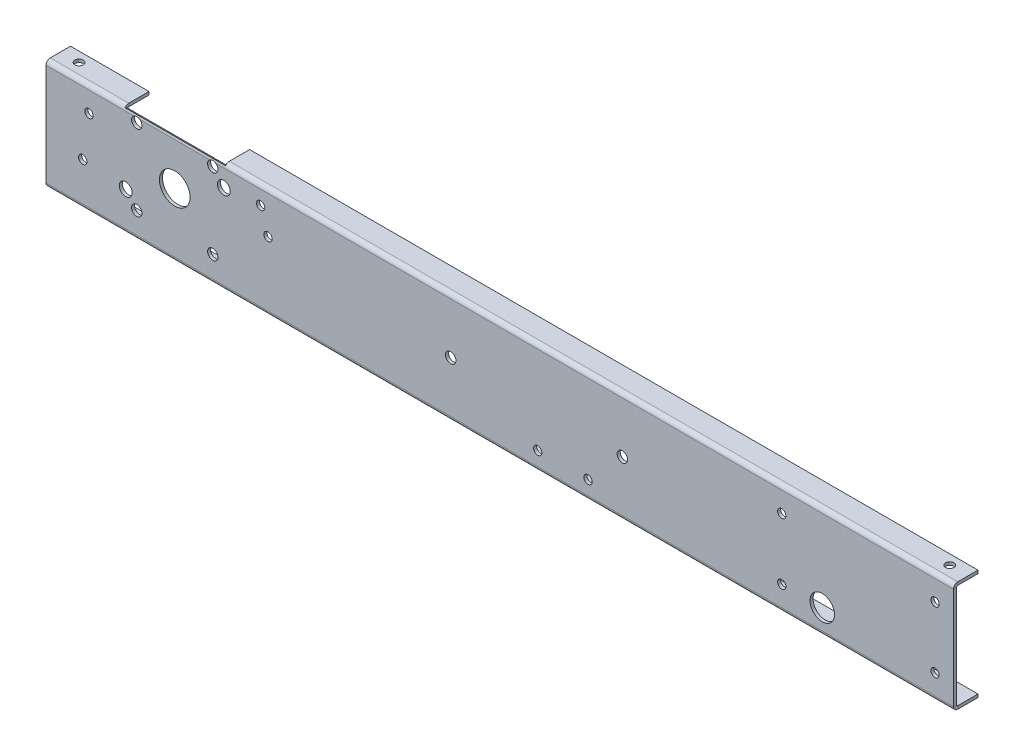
ISO-10303-21;
HEADER;
FILE_DESCRIPTION(('STEP AP214'),'2;1');
FILE_NAME('part.step','',(''),(''),'','','');
FILE_SCHEMA(('AUTOMOTIVE_DESIGN { 1 0 10303 214 1 1 1 1 }'));
ENDSEC;
DATA;
#1=APPLICATION_CONTEXT('core data for automotive mechanical design processes');
#2=APPLICATION_PROTOCOL_DEFINITION('international standard','automotive_design',2000,#1);
#3=PRODUCT_CONTEXT('',#1,'mechanical');
#4=PRODUCT('Part','Part','',(#3));
#5=PRODUCT_RELATED_PRODUCT_CATEGORY('part','',(#4));
#6=PRODUCT_DEFINITION_FORMATION('','',#4);
#7=PRODUCT_DEFINITION_CONTEXT('part definition',#1,'design');
#8=PRODUCT_DEFINITION('design','',#6,#7);
#9=PRODUCT_DEFINITION_SHAPE('','',#8);
#10=(LENGTH_UNIT() NAMED_UNIT(*) SI_UNIT(.MILLI.,.METRE.));
#11=(NAMED_UNIT(*) PLANE_ANGLE_UNIT() SI_UNIT($,.RADIAN.));
#12=(NAMED_UNIT(*) SI_UNIT($,.STERADIAN.) SOLID_ANGLE_UNIT());
#13=UNCERTAINTY_MEASURE_WITH_UNIT(LENGTH_MEASURE(1.E-05),#10,'distance_accuracy_value','');
#14=(GEOMETRIC_REPRESENTATION_CONTEXT(3) GLOBAL_UNCERTAINTY_ASSIGNED_CONTEXT((#13)) GLOBAL_UNIT_ASSIGNED_CONTEXT((#10,
#11,#12)) REPRESENTATION_CONTEXT('',''));
#15=CARTESIAN_POINT('',(0.,0.,0.));
#16=DIRECTION('',(0.,0.,1.));
#17=DIRECTION('',(1.,0.,0.));
#18=AXIS2_PLACEMENT_3D('',#15,#16,#17);
#19=CARTESIAN_POINT('',(-740.,86.5,-3.5));
#20=DIRECTION('',(1.,0.,0.));
#21=DIRECTION('',(0.,0.,-1.));
#22=AXIS2_PLACEMENT_3D('',#19,#20,#21);
#23=CYLINDRICAL_SURFACE('',#22,1.);
#24=CARTESIAN_POINT('',(-668.410912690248,86.5,-2.5));
#25=CARTESIAN_POINT('',(-668.343303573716,86.5465825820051,-2.50003894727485));
#26=CARTESIAN_POINT('',(-668.27441602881,86.5911351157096,-2.50324974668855));
#27=CARTESIAN_POINT('',(-668.134614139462,86.6759449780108,-2.51466343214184));
#28=CARTESIAN_POINT('',(-668.063704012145,86.7162105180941,-2.5228565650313));
#29=CARTESIAN_POINT('',(-667.919713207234,86.7926101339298,-2.54295069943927));
#30=CARTESIAN_POINT('',(-667.846622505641,86.8287195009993,-2.55487245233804));
#31=CARTESIAN_POINT('',(-667.698838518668,86.8965446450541,-2.58126276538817));
#32=CARTESIAN_POINT('',(-667.624144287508,86.9282577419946,-2.59573286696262));
#33=CARTESIAN_POINT('',(-667.441127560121,86.9998761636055,-2.63261069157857));
#34=CARTESIAN_POINT('',(-667.332060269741,87.0375001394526,-2.65577011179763));
#35=CARTESIAN_POINT('',(-667.111137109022,87.1038011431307,-2.70184400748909));
#36=CARTESIAN_POINT('',(-666.999279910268,87.1324738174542,-2.72475835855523));
#37=CARTESIAN_POINT('',(-666.773776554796,87.1805443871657,-2.76660542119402));
#38=CARTESIAN_POINT('',(-666.660151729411,87.2000143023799,-2.78556837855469));
#39=CARTESIAN_POINT('',(-666.430736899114,87.2296928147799,-2.81588326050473));
#40=CARTESIAN_POINT('',(-666.314949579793,87.239912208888,-2.82724405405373));
#41=CARTESIAN_POINT('',(-666.104787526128,87.249747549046,-2.83824561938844));
#42=CARTESIAN_POINT('',(-666.010588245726,87.2510279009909,-2.83972363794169));
#43=CARTESIAN_POINT('',(-665.822460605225,87.2473323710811,-2.83554374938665));
#44=CARTESIAN_POINT('',(-665.728532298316,87.2423553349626,-2.82988452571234));
#45=CARTESIAN_POINT('',(-665.541126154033,87.226210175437,-2.81242800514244));
#46=CARTESIAN_POINT('',(-665.447656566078,87.2149972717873,-2.80058634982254));
#47=CARTESIAN_POINT('',(-665.262297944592,87.1865372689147,-2.77263373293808));
#48=CARTESIAN_POINT('',(-665.170409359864,87.1692884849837,-2.75652157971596));
#49=CARTESIAN_POINT('',(-664.964920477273,87.1236955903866,-2.71762205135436));
#50=CARTESIAN_POINT('',(-664.851824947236,87.0936378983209,-2.69418431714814));
#51=CARTESIAN_POINT('',(-664.628407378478,87.024291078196,-2.64743249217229));
#52=CARTESIAN_POINT('',(-664.518086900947,86.9849968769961,-2.62411847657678));
#53=CARTESIAN_POINT('',(-664.301212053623,86.8974609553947,-2.58109233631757));
#54=CARTESIAN_POINT('',(-664.194637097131,86.8492822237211,-2.56135668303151));
#55=CARTESIAN_POINT('',(-663.985085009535,86.7438381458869,-2.52861498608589));
#56=CARTESIAN_POINT('',(-663.882102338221,86.6865876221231,-2.51559810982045));
#57=CARTESIAN_POINT('',(-663.748886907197,86.6050588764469,-2.50533235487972));
#58=CARTESIAN_POINT('',(-663.716586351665,86.5846872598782,-2.5033741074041));
#59=CARTESIAN_POINT('',(-663.652457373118,86.5430223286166,-2.50070749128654));
#60=CARTESIAN_POINT('',(-663.620629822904,86.5217275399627,-2.50000120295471));
#61=CARTESIAN_POINT('',(-663.589087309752,86.4999999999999,-2.5));
#62=B_SPLINE_CURVE_WITH_KNOTS('',3,(#24,#25,#26,#27,#28,#29,#30,#31,#32,#33,#34,#35,#36,#37,#38,
#39,#40,#41,#42,#43,#44,#45,#46,#47,#48,#49,#50,#51,#52,#53,#54,#55,#56,#57,#58,#59,#60,#61),
.UNSPECIFIED.,.F.,.F.,(4,2,2,2,2,2,2,2,2,2,2,2,2,2,2,2,2,2,4),(0.,0.246074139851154,
0.491668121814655,0.738654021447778,0.985789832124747,1.33841616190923,1.69121372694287,
2.0412026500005,2.3907825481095,2.67296686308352,2.9552032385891,3.23949304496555,
3.52386226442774,3.881487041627,4.23930870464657,4.59468478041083,4.94948608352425,
5.06417232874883,5.17904896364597),.UNSPECIFIED.);
#63=CARTESIAN_POINT('',(-668.410912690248,86.5,-2.5));
#64=VERTEX_POINT('',#63);
#65=CARTESIAN_POINT('',(-667.436140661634,87.,-2.63397459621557));
#66=VERTEX_POINT('',#65);
#67=EDGE_CURVE('E636',#64,#66,#62,.T.);
#68=ORIENTED_EDGE('',*,*,#67,.F.);
#69=DIRECTION('',(1.,0.,0.));
#70=VECTOR('',#69,1.);
#71=CARTESIAN_POINT('',(-740.,86.5,-2.5));
#72=LINE('',#71,#70);
#73=CARTESIAN_POINT('',(-740.,86.5,-2.5));
#74=VERTEX_POINT('',#73);
#75=EDGE_CURVE('E845',#74,#64,#72,.T.);
#76=ORIENTED_EDGE('',*,*,#75,.F.);
#77=CARTESIAN_POINT('',(-740.,86.5,-3.5));
#78=DIRECTION('',(1.,0.,0.));
#79=DIRECTION('',(0.,0.,-1.));
#80=AXIS2_PLACEMENT_3D('',#77,#78,#79);
#81=CIRCLE('',#80,1.);
#82=CARTESIAN_POINT('',(-740.,87.5,-3.5));
#83=VERTEX_POINT('',#82);
#84=EDGE_CURVE('E834',#74,#83,#81,.F.);
#85=ORIENTED_EDGE('',*,*,#84,.T.);
#86=DIRECTION('',(1.,0.,0.));
#87=VECTOR('',#86,1.);
#88=CARTESIAN_POINT('',(-740.,87.5,-3.5));
#89=LINE('',#88,#87);
#90=CARTESIAN_POINT('',(-676.,87.5,-3.5));
#91=VERTEX_POINT('',#90);
#92=EDGE_CURVE('E839',#83,#91,#89,.T.);
#93=ORIENTED_EDGE('',*,*,#92,.T.);
#94=CARTESIAN_POINT('',(-676.,86.5,-3.5));
#95=DIRECTION('',(1.,0.,0.));
#96=DIRECTION('',(0.,0.,-1.));
#97=AXIS2_PLACEMENT_3D('',#94,#95,#96);
#98=CIRCLE('',#97,1.);
#99=CARTESIAN_POINT('',(-676.,87.,-2.63397459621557));
#100=VERTEX_POINT('',#99);
#101=EDGE_CURVE('E751',#100,#91,#98,.F.);
#102=ORIENTED_EDGE('',*,*,#101,.F.);
#103=DIRECTION('',(1.,0.,0.));
#104=VECTOR('',#103,1.);
#105=CARTESIAN_POINT('',(-740.,87.,-2.63397459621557));
#106=LINE('',#105,#104);
#107=EDGE_CURVE('E723',#66,#100,#106,.F.);
#108=ORIENTED_EDGE('',*,*,#107,.F.);
#109=EDGE_LOOP('',(#68,#76,#85,#93,#102,#108));
#110=FACE_BOUND('',#109,.T.);
#111=ADVANCED_FACE('F202',(#110),#23,.F.);
#112=CARTESIAN_POINT('',(-664.563859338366,87.,-2.63397459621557));
#113=VERTEX_POINT('',#112);
#114=CARTESIAN_POINT('',(-663.589087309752,86.5,-2.5));
#115=VERTEX_POINT('',#114);
#116=EDGE_CURVE('E628',#113,#115,#62,.T.);
#117=ORIENTED_EDGE('',*,*,#116,.F.);
#118=CARTESIAN_POINT('',(-605.436140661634,87.,-2.63397459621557));
#119=VERTEX_POINT('',#118);
#120=EDGE_CURVE('E729',#119,#113,#106,.F.);
#121=ORIENTED_EDGE('',*,*,#120,.F.);
#122=CARTESIAN_POINT('',(-606.410912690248,86.5,-2.5));
#123=CARTESIAN_POINT('',(-606.343303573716,86.5465825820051,-2.50003894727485));
#124=CARTESIAN_POINT('',(-606.27441602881,86.5911351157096,-2.50324974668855));
#125=CARTESIAN_POINT('',(-606.134614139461,86.6759449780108,-2.51466343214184));
#126=CARTESIAN_POINT('',(-606.063704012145,86.7162105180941,-2.5228565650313));
#127=CARTESIAN_POINT('',(-605.919713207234,86.7926101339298,-2.54295069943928));
#128=CARTESIAN_POINT('',(-605.846622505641,86.8287195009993,-2.55487245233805));
#129=CARTESIAN_POINT('',(-605.698838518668,86.8965446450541,-2.58126276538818));
#130=CARTESIAN_POINT('',(-605.624144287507,86.9282577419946,-2.59573286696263));
#131=CARTESIAN_POINT('',(-605.441127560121,86.9998761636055,-2.63261069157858));
#132=CARTESIAN_POINT('',(-605.332060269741,87.0375001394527,-2.65577011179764));
#133=CARTESIAN_POINT('',(-605.111137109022,87.1038011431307,-2.7018440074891));
#134=CARTESIAN_POINT('',(-604.999279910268,87.1324738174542,-2.72475835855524));
#135=CARTESIAN_POINT('',(-604.773776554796,87.1805443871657,-2.76660542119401));
#136=CARTESIAN_POINT('',(-604.660151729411,87.2000143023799,-2.78556837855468));
#137=CARTESIAN_POINT('',(-604.430736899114,87.2296928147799,-2.81588326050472));
#138=CARTESIAN_POINT('',(-604.314949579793,87.239912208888,-2.82724405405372));
#139=CARTESIAN_POINT('',(-604.104787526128,87.249747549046,-2.83824561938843));
#140=CARTESIAN_POINT('',(-604.010588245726,87.2510279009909,-2.83972363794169));
#141=CARTESIAN_POINT('',(-603.822460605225,87.2473323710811,-2.83554374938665));
#142=CARTESIAN_POINT('',(-603.728532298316,87.2423553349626,-2.82988452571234));
#143=CARTESIAN_POINT('',(-603.541126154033,87.226210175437,-2.81242800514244));
#144=CARTESIAN_POINT('',(-603.447656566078,87.2149972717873,-2.80058634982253));
#145=CARTESIAN_POINT('',(-603.262297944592,87.1865372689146,-2.77263373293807));
#146=CARTESIAN_POINT('',(-603.170409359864,87.1692884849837,-2.75652157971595));
#147=CARTESIAN_POINT('',(-602.964920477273,87.1236955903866,-2.71762205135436));
#148=CARTESIAN_POINT('',(-602.851824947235,87.0936378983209,-2.69418431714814));
#149=CARTESIAN_POINT('',(-602.628407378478,87.024291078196,-2.64743249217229));
#150=CARTESIAN_POINT('',(-602.518086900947,86.9849968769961,-2.62411847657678));
#151=CARTESIAN_POINT('',(-602.301212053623,86.8974609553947,-2.58109233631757));
#152=CARTESIAN_POINT('',(-602.194637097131,86.8492822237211,-2.56135668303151));
#153=CARTESIAN_POINT('',(-601.985085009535,86.7438381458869,-2.52861498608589));
#154=CARTESIAN_POINT('',(-601.882102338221,86.6865876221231,-2.51559810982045));
#155=CARTESIAN_POINT('',(-601.748886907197,86.6050588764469,-2.50533235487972));
#156=CARTESIAN_POINT('',(-601.716586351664,86.5846872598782,-2.5033741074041));
#157=CARTESIAN_POINT('',(-601.652457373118,86.5430223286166,-2.50070749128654));
#158=CARTESIAN_POINT('',(-601.620629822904,86.5217275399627,-2.50000120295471));
#159=CARTESIAN_POINT('',(-601.589087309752,86.4999999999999,-2.5));
#160=B_SPLINE_CURVE_WITH_KNOTS('',3,(#122,#123,#124,#125,#126,#127,#128,#129,#130,#131,#132,
#133,#134,#135,#136,#137,#138,#139,#140,#141,#142,#143,#144,#145,#146,#147,#148,#149,#150,#151,
#152,#153,#154,#155,#156,#157,#158,#159),.UNSPECIFIED.,.F.,.F.,(4,2,2,2,2,2,2,2,2,2,2,2,2,2,2,2,
2,2,4),(0.,0.246074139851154,0.491668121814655,0.738654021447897,0.985789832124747,
1.33841616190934,1.69121372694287,2.04120265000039,2.3907825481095,2.67296686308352,
2.9552032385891,3.23949304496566,3.52386226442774,3.881487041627,4.23930870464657,
4.59468478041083,4.94948608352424,5.06417232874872,5.17904896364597),.UNSPECIFIED.);
#161=CARTESIAN_POINT('',(-606.410912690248,86.5,-2.5));
#162=VERTEX_POINT('',#161);
#163=EDGE_CURVE('E913',#162,#119,#160,.T.);
#164=ORIENTED_EDGE('',*,*,#163,.F.);
#165=EDGE_CURVE('E849',#115,#162,#72,.T.);
#166=ORIENTED_EDGE('',*,*,#165,.F.);
#167=EDGE_LOOP('',(#117,#121,#164,#166));
#168=FACE_BOUND('',#167,.T.);
#169=ADVANCED_FACE('F1022',(#168),#23,.F.);
#170=CARTESIAN_POINT('',(-740.,87.5,0.));
#171=DIRECTION('',(0.,-1.,0.));
#172=DIRECTION('',(0.,0.,-1.));
#173=AXIS2_PLACEMENT_3D('',#170,#171,#172);
#174=PLANE('',#173);
#175=CARTESIAN_POINT('',(-725.,87.5,-12.));
#176=DIRECTION('',(0.,-1.,0.));
#177=DIRECTION('',(0.,0.,-1.));
#178=AXIS2_PLACEMENT_3D('',#175,#176,#177);
#179=CIRCLE('',#178,3.39999999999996);
#180=CARTESIAN_POINT('',(-725.,87.5,-15.4));
#181=VERTEX_POINT('',#180);
#182=EDGE_CURVE('E711',#181,#181,#179,.T.);
#183=ORIENTED_EDGE('',*,*,#182,.F.);
#184=EDGE_LOOP('',(#183));
#185=FACE_BOUND('',#184,.T.);
#186=DIRECTION('',(1.,0.,0.));
#187=VECTOR('',#186,1.);
#188=CARTESIAN_POINT('',(-740.,87.5,-20.));
#189=LINE('',#188,#187);
#190=CARTESIAN_POINT('',(-740.,87.5,-20.));
#191=VERTEX_POINT('',#190);
#192=CARTESIAN_POINT('',(-676.,87.5,-20.));
#193=VERTEX_POINT('',#192);
#194=EDGE_CURVE('E867',#191,#193,#189,.T.);
#195=ORIENTED_EDGE('',*,*,#194,.T.);
#196=DIRECTION('',(0.,0.,-1.));
#197=VECTOR('',#196,1.);
#198=CARTESIAN_POINT('',(-676.,87.5,0.));
#199=LINE('',#198,#197);
#200=EDGE_CURVE('E758',#91,#193,#199,.T.);
#201=ORIENTED_EDGE('',*,*,#200,.F.);
#202=ORIENTED_EDGE('',*,*,#92,.F.);
#203=DIRECTION('',(0.,0.,-1.));
#204=VECTOR('',#203,1.);
#205=CARTESIAN_POINT('',(-740.,87.5,0.));
#206=LINE('',#205,#204);
#207=EDGE_CURVE('E812',#83,#191,#206,.T.);
#208=ORIENTED_EDGE('',*,*,#207,.T.);
#209=EDGE_LOOP('',(#195,#201,#202,#208));
#210=FACE_BOUND('',#209,.T.);
#211=ADVANCED_FACE('F1026',(#185,#210),#174,.T.);
#212=CARTESIAN_POINT('',(-15.,87.5,-12.));
#213=DIRECTION('',(0.,-1.,0.));
#214=DIRECTION('',(0.,0.,-1.));
#215=AXIS2_PLACEMENT_3D('',#212,#213,#214);
#216=CIRCLE('',#215,3.39999999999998);
#217=CARTESIAN_POINT('',(-15.,87.5,-15.4));
#218=VERTEX_POINT('',#217);
#219=EDGE_CURVE('E719',#218,#218,#216,.T.);
#220=ORIENTED_EDGE('',*,*,#219,.F.);
#221=EDGE_LOOP('',(#220));
#222=FACE_BOUND('',#221,.T.);
#223=CARTESIAN_POINT('',(-594.,87.5,-3.5));
#224=VERTEX_POINT('',#223);
#225=CARTESIAN_POINT('',(0.,87.5,-3.5));
#226=VERTEX_POINT('',#225);
#227=EDGE_CURVE('E844',#224,#226,#89,.T.);
#228=ORIENTED_EDGE('',*,*,#227,.F.);
#229=DIRECTION('',(0.,0.,1.));
#230=VECTOR('',#229,1.);
#231=CARTESIAN_POINT('',(-594.,87.5,9.26243209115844E-13));
#232=LINE('',#231,#230);
#233=CARTESIAN_POINT('',(-594.,87.5,-20.));
#234=VERTEX_POINT('',#233);
#235=EDGE_CURVE('E754',#234,#224,#232,.T.);
#236=ORIENTED_EDGE('',*,*,#235,.F.);
#237=CARTESIAN_POINT('',(0.,87.5,-20.));
#238=VERTEX_POINT('',#237);
#239=EDGE_CURVE('E838',#234,#238,#189,.T.);
#240=ORIENTED_EDGE('',*,*,#239,.T.);
#241=DIRECTION('',(0.,0.,-1.));
#242=VECTOR('',#241,1.);
#243=CARTESIAN_POINT('',(0.,87.5,0.));
#244=LINE('',#243,#242);
#245=EDGE_CURVE('E781',#226,#238,#244,.T.);
#246=ORIENTED_EDGE('',*,*,#245,.F.);
#247=EDGE_LOOP('',(#228,#236,#240,#246));
#248=FACE_BOUND('',#247,.T.);
#249=ADVANCED_FACE('F922',(#222,#248),#174,.T.);
#250=CARTESIAN_POINT('',(-602.563859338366,87.,-2.63397459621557));
#251=VERTEX_POINT('',#250);
#252=CARTESIAN_POINT('',(-601.589087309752,86.5,-2.5));
#253=VERTEX_POINT('',#252);
#254=EDGE_CURVE('E911',#251,#253,#160,.T.);
#255=ORIENTED_EDGE('',*,*,#254,.F.);
#256=CARTESIAN_POINT('',(-594.,87.,-2.63397459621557));
#257=VERTEX_POINT('',#256);
#258=EDGE_CURVE('E724',#257,#251,#106,.F.);
#259=ORIENTED_EDGE('',*,*,#258,.F.);
#260=CARTESIAN_POINT('',(-594.,86.5,-3.5));
#261=DIRECTION('',(1.,0.,0.));
#262=DIRECTION('',(0.,0.,-1.));
#263=AXIS2_PLACEMENT_3D('',#260,#261,#262);
#264=CIRCLE('',#263,1.);
#265=EDGE_CURVE('E748',#224,#257,#264,.T.);
#266=ORIENTED_EDGE('',*,*,#265,.F.);
#267=ORIENTED_EDGE('',*,*,#227,.T.);
#268=CARTESIAN_POINT('',(0.,86.5,-3.5));
#269=DIRECTION('',(1.,0.,0.));
#270=DIRECTION('',(0.,0.,-1.));
#271=AXIS2_PLACEMENT_3D('',#268,#269,#270);
#272=CIRCLE('',#271,1.);
#273=CARTESIAN_POINT('',(0.,86.5,-2.5));
#274=VERTEX_POINT('',#273);
#275=EDGE_CURVE('E808',#274,#226,#272,.F.);
#276=ORIENTED_EDGE('',*,*,#275,.F.);
#277=EDGE_CURVE('E850',#253,#274,#72,.T.);
#278=ORIENTED_EDGE('',*,*,#277,.F.);
#279=EDGE_LOOP('',(#255,#259,#266,#267,#276,#278));
#280=FACE_BOUND('',#279,.T.);
#281=ADVANCED_FACE('F639',(#280),#23,.F.);
#282=CARTESIAN_POINT('',(-740.,86.5,-3.5));
#283=DIRECTION('',(1.,0.,0.));
#284=DIRECTION('',(0.,0.,-1.));
#285=AXIS2_PLACEMENT_3D('',#282,#283,#284);
#286=CYLINDRICAL_SURFACE('',#285,3.5);
#287=DIRECTION('',(1.,0.,0.));
#288=VECTOR('',#287,1.);
#289=CARTESIAN_POINT('',(-740.,86.4999999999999,0.));
#290=LINE('',#289,#288);
#291=CARTESIAN_POINT('',(-740.,86.4999999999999,0.));
#292=VERTEX_POINT('',#291);
#293=CARTESIAN_POINT('',(-668.410912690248,86.4999999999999,0.));
#294=VERTEX_POINT('',#293);
#295=EDGE_CURVE('E851',#292,#294,#290,.T.);
#296=ORIENTED_EDGE('',*,*,#295,.T.);
#297=CARTESIAN_POINT('',(-668.410912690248,86.4999999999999,0.));
#298=CARTESIAN_POINT('',(-668.313119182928,86.5673785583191,-2.11368632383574E-05));
#299=CARTESIAN_POINT('',(-668.212517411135,86.6306175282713,-0.00194619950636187));
#300=CARTESIAN_POINT('',(-668.006468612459,86.7484174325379,-0.00832329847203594));
#301=CARTESIAN_POINT('',(-667.901023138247,86.8029811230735,-0.0127745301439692));
#302=CARTESIAN_POINT('',(-667.685965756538,86.9030886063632,-0.0229261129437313));
#303=CARTESIAN_POINT('',(-667.576352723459,86.9486299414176,-0.0286268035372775));
#304=CARTESIAN_POINT('',(-667.353703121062,87.0303908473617,-0.0401742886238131));
#305=CARTESIAN_POINT('',(-667.240666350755,87.0666098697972,-0.0460210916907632));
#306=CARTESIAN_POINT('',(-667.011916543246,87.1294788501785,-0.0569236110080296));
#307=CARTESIAN_POINT('',(-666.896203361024,87.1561282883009,-0.0619792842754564));
#308=CARTESIAN_POINT('',(-666.662899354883,87.1996600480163,-0.0705730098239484));
#309=CARTESIAN_POINT('',(-666.545308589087,87.2165426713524,-0.0741111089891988));
#310=CARTESIAN_POINT('',(-666.30917048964,87.2403991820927,-0.0791874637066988));
#311=CARTESIAN_POINT('',(-666.190623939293,87.2473804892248,-0.0807272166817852));
#312=CARTESIAN_POINT('',(-665.953356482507,87.2513999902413,-0.0816081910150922));
#313=CARTESIAN_POINT('',(-665.834635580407,87.248438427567,-0.0809494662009));
#314=CARTESIAN_POINT('',(-665.598922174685,87.2326667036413,-0.0775355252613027));
#315=CARTESIAN_POINT('',(-665.481923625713,87.2199426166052,-0.0747986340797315));
#316=CARTESIAN_POINT('',(-665.249429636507,87.1848497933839,-0.0676100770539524));
#317=CARTESIAN_POINT('',(-665.133934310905,87.1624803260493,-0.0631582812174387));
#318=CARTESIAN_POINT('',(-664.905230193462,87.1082587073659,-0.0531492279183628));
#319=CARTESIAN_POINT('',(-664.79202157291,87.0764058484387,-0.0475918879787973));
#320=CARTESIAN_POINT('',(-664.568684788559,87.0034536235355,-0.0362022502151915));
#321=CARTESIAN_POINT('',(-664.458555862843,86.9623565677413,-0.0303700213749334));
#322=CARTESIAN_POINT('',(-664.216708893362,86.8604870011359,-0.018152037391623));
#323=CARTESIAN_POINT('',(-664.08595748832,86.79736092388,-0.0119552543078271));
#324=CARTESIAN_POINT('',(-663.895288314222,86.6929576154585,-0.00515002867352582));
#325=CARTESIAN_POINT('',(-663.832689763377,86.6565706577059,-0.00329710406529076));
#326=CARTESIAN_POINT('',(-663.709411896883,86.5806347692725,-0.000723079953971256));
#327=CARTESIAN_POINT('',(-663.648732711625,86.5410856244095,-2.05718553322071E-06));
#328=CARTESIAN_POINT('',(-663.589087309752,86.5,0.));
#329=B_SPLINE_CURVE_WITH_KNOTS('',3,(#297,#298,#299,#300,#301,#302,#303,#304,#305,#306,#307,
#308,#309,#310,#311,#312,#313,#314,#315,#316,#317,#318,#319,#320,#321,#322,#323,#324,#325,#326,
#327,#328),.UNSPECIFIED.,.F.,.F.,(4,2,2,2,2,2,2,2,2,2,2,2,2,2,2,4),(0.,0.356104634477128,
0.712095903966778,1.068184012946,1.42429306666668,1.78042146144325,2.13653885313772,
2.49238924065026,2.84823091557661,3.20097075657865,3.55373734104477,3.90653025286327,
4.25923509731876,4.69433457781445,4.91153502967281,5.12875020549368),.UNSPECIFIED.);
#330=CARTESIAN_POINT('',(-663.589087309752,86.4999999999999,0.));
#331=VERTEX_POINT('',#330);
#332=EDGE_CURVE('E225',#294,#331,#329,.T.);
#333=ORIENTED_EDGE('',*,*,#332,.T.);
#334=CARTESIAN_POINT('',(-606.410912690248,86.4999999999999,0.));
#335=VERTEX_POINT('',#334);
#336=EDGE_CURVE('E855',#331,#335,#290,.T.);
#337=ORIENTED_EDGE('',*,*,#336,.T.);
#338=CARTESIAN_POINT('',(-606.410912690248,86.4999999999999,0.));
#339=CARTESIAN_POINT('',(-606.313119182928,86.5673785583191,-2.11368632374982E-05));
#340=CARTESIAN_POINT('',(-606.212517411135,86.6306175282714,-0.00194619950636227));
#341=CARTESIAN_POINT('',(-606.006468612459,86.748417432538,-0.00832329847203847));
#342=CARTESIAN_POINT('',(-605.901023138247,86.8029811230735,-0.0127745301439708));
#343=CARTESIAN_POINT('',(-605.685965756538,86.9030886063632,-0.0229261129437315));
#344=CARTESIAN_POINT('',(-605.576352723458,86.9486299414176,-0.0286268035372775));
#345=CARTESIAN_POINT('',(-605.353703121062,87.0303908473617,-0.0401742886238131));
#346=CARTESIAN_POINT('',(-605.240666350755,87.0666098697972,-0.0460210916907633));
#347=CARTESIAN_POINT('',(-605.011916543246,87.1294788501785,-0.0569236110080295));
#348=CARTESIAN_POINT('',(-604.896203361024,87.1561282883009,-0.061979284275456));
#349=CARTESIAN_POINT('',(-604.662899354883,87.1996600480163,-0.070573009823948));
#350=CARTESIAN_POINT('',(-604.545308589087,87.2165426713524,-0.0741111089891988));
#351=CARTESIAN_POINT('',(-604.30917048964,87.2403991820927,-0.0791874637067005));
#352=CARTESIAN_POINT('',(-604.190623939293,87.2473804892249,-0.080727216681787));
#353=CARTESIAN_POINT('',(-603.953356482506,87.2513999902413,-0.0816081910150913));
#354=CARTESIAN_POINT('',(-603.834635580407,87.248438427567,-0.080949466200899));
#355=CARTESIAN_POINT('',(-603.598922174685,87.2326667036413,-0.0775355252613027));
#356=CARTESIAN_POINT('',(-603.481923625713,87.2199426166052,-0.0747986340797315));
#357=CARTESIAN_POINT('',(-603.249429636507,87.1848497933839,-0.0676100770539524));
#358=CARTESIAN_POINT('',(-603.133934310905,87.1624803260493,-0.0631582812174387));
#359=CARTESIAN_POINT('',(-602.905230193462,87.1082587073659,-0.0531492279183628));
#360=CARTESIAN_POINT('',(-602.79202157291,87.0764058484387,-0.0475918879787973));
#361=CARTESIAN_POINT('',(-602.568684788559,87.0034536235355,-0.0362022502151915));
#362=CARTESIAN_POINT('',(-602.458555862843,86.9623565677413,-0.0303700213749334));
#363=CARTESIAN_POINT('',(-602.216708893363,86.8604870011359,-0.018152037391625));
#364=CARTESIAN_POINT('',(-602.08595748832,86.7973609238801,-0.0119552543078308));
#365=CARTESIAN_POINT('',(-601.895288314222,86.6929576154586,-0.00515002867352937));
#366=CARTESIAN_POINT('',(-601.832689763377,86.656570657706,-0.00329710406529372));
#367=CARTESIAN_POINT('',(-601.709411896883,86.5806347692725,-0.000723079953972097));
#368=CARTESIAN_POINT('',(-601.648732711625,86.5410856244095,-2.05718553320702E-06));
#369=CARTESIAN_POINT('',(-601.589087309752,86.5,0.));
#370=B_SPLINE_CURVE_WITH_KNOTS('',3,(#338,#339,#340,#341,#342,#343,#344,#345,#346,#347,#348,
#349,#350,#351,#352,#353,#354,#355,#356,#357,#358,#359,#360,#361,#362,#363,#364,#365,#366,#367,
#368,#369),.UNSPECIFIED.,.F.,.F.,(4,2,2,2,2,2,2,2,2,2,2,2,2,2,2,4),(0.,0.356104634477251,
0.712095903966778,1.068184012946,1.42429306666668,1.78042146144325,2.13653885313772,
2.49238924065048,2.84823091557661,3.20097075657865,3.55373734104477,3.90653025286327,
4.25923509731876,4.69433457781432,4.91153502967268,5.12875020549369),.UNSPECIFIED.);
#371=CARTESIAN_POINT('',(-601.589087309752,86.4999999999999,0.));
#372=VERTEX_POINT('',#371);
#373=EDGE_CURVE('E674',#335,#372,#370,.T.);
#374=ORIENTED_EDGE('',*,*,#373,.T.);
#375=CARTESIAN_POINT('',(0.,86.4999999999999,0.));
#376=VERTEX_POINT('',#375);
#377=EDGE_CURVE('E856',#372,#376,#290,.T.);
#378=ORIENTED_EDGE('',*,*,#377,.T.);
#379=CARTESIAN_POINT('',(0.,86.5,-3.5));
#380=DIRECTION('',(1.,0.,0.));
#381=DIRECTION('',(0.,0.,-1.));
#382=AXIS2_PLACEMENT_3D('',#379,#380,#381);
#383=CIRCLE('',#382,3.5);
#384=CARTESIAN_POINT('',(0.,90.,-3.5));
#385=VERTEX_POINT('',#384);
#386=EDGE_CURVE('E796',#376,#385,#383,.F.);
#387=ORIENTED_EDGE('',*,*,#386,.T.);
#388=DIRECTION('',(1.,0.,0.));
#389=VECTOR('',#388,1.);
#390=CARTESIAN_POINT('',(-740.,90.,-3.5));
#391=LINE('',#390,#389);
#392=CARTESIAN_POINT('',(-594.,90.,-3.5));
#393=VERTEX_POINT('',#392);
#394=EDGE_CURVE('E861',#393,#385,#391,.T.);
#395=ORIENTED_EDGE('',*,*,#394,.F.);
#396=CARTESIAN_POINT('',(-594.,86.5,-3.5));
#397=DIRECTION('',(1.,0.,0.));
#398=DIRECTION('',(0.,0.,-1.));
#399=AXIS2_PLACEMENT_3D('',#396,#397,#398);
#400=CIRCLE('',#399,3.5);
#401=CARTESIAN_POINT('',(-594.,88.25,-0.468911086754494));
#402=VERTEX_POINT('',#401);
#403=EDGE_CURVE('E741',#393,#402,#400,.T.);
#404=ORIENTED_EDGE('',*,*,#403,.T.);
#405=DIRECTION('',(1.,0.,0.));
#406=VECTOR('',#405,1.);
#407=CARTESIAN_POINT('',(-740.,88.25,-0.468911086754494));
#408=LINE('',#407,#406);
#409=CARTESIAN_POINT('',(-676.,88.25,-0.468911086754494));
#410=VERTEX_POINT('',#409);
#411=EDGE_CURVE('E728',#402,#410,#408,.F.);
#412=ORIENTED_EDGE('',*,*,#411,.T.);
#413=CARTESIAN_POINT('',(-676.,86.5,-3.5));
#414=DIRECTION('',(-1.,0.,0.));
#415=DIRECTION('',(0.,0.,1.));
#416=AXIS2_PLACEMENT_3D('',#413,#414,#415);
#417=CIRCLE('',#416,3.5);
#418=CARTESIAN_POINT('',(-676.,90.,-3.5));
#419=VERTEX_POINT('',#418);
#420=EDGE_CURVE('E744',#410,#419,#417,.T.);
#421=ORIENTED_EDGE('',*,*,#420,.T.);
#422=CARTESIAN_POINT('',(-740.,90.,-3.5));
#423=VERTEX_POINT('',#422);
#424=EDGE_CURVE('E857',#423,#419,#391,.T.);
#425=ORIENTED_EDGE('',*,*,#424,.F.);
#426=CARTESIAN_POINT('',(-740.,86.5,-3.5));
#427=DIRECTION('',(1.,0.,0.));
#428=DIRECTION('',(0.,0.,-1.));
#429=AXIS2_PLACEMENT_3D('',#426,#427,#428);
#430=CIRCLE('',#429,3.5);
#431=EDGE_CURVE('E822',#292,#423,#430,.F.);
#432=ORIENTED_EDGE('',*,*,#431,.F.);
#433=EDGE_LOOP('',(#296,#333,#337,#374,#378,#387,#395,#404,#412,#421,#425,#432));
#434=FACE_BOUND('',#433,.T.);
#435=ADVANCED_FACE('F663',(#434),#286,.T.);
#436=CARTESIAN_POINT('',(-740.,90.,0.));
#437=DIRECTION('',(0.,-1.,0.));
#438=DIRECTION('',(0.,0.,-1.));
#439=AXIS2_PLACEMENT_3D('',#436,#437,#438);
#440=PLANE('',#439);
#441=CARTESIAN_POINT('',(-725.,90.,-12.));
#442=DIRECTION('',(0.,1.,0.));
#443=DIRECTION('',(0.,0.,1.));
#444=AXIS2_PLACEMENT_3D('',#441,#442,#443);
#445=CIRCLE('',#444,3.39999999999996);
#446=CARTESIAN_POINT('',(-725.,90.,-8.60000000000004));
#447=VERTEX_POINT('',#446);
#448=EDGE_CURVE('E707',#447,#447,#445,.T.);
#449=ORIENTED_EDGE('',*,*,#448,.F.);
#450=EDGE_LOOP('',(#449));
#451=FACE_BOUND('',#450,.T.);
#452=DIRECTION('',(0.,0.,-1.));
#453=VECTOR('',#452,1.);
#454=CARTESIAN_POINT('',(-676.,90.,0.));
#455=LINE('',#454,#453);
#456=CARTESIAN_POINT('',(-676.,90.,-20.));
#457=VERTEX_POINT('',#456);
#458=EDGE_CURVE('E762',#419,#457,#455,.T.);
#459=ORIENTED_EDGE('',*,*,#458,.T.);
#460=DIRECTION('',(1.,0.,0.));
#461=VECTOR('',#460,1.);
#462=CARTESIAN_POINT('',(-740.,90.,-20.));
#463=LINE('',#462,#461);
#464=CARTESIAN_POINT('',(-740.,90.,-20.));
#465=VERTEX_POINT('',#464);
#466=EDGE_CURVE('E862',#465,#457,#463,.T.);
#467=ORIENTED_EDGE('',*,*,#466,.F.);
#468=DIRECTION('',(0.,0.,-1.));
#469=VECTOR('',#468,1.);
#470=CARTESIAN_POINT('',(-740.,90.,0.));
#471=LINE('',#470,#469);
#472=EDGE_CURVE('E819',#423,#465,#471,.T.);
#473=ORIENTED_EDGE('',*,*,#472,.F.);
#474=ORIENTED_EDGE('',*,*,#424,.T.);
#475=EDGE_LOOP('',(#459,#467,#473,#474));
#476=FACE_BOUND('',#475,.T.);
#477=ADVANCED_FACE('F668',(#451,#476),#440,.F.);
#478=CARTESIAN_POINT('',(-15.,90.,-12.));
#479=DIRECTION('',(0.,1.,0.));
#480=DIRECTION('',(0.,0.,1.));
#481=AXIS2_PLACEMENT_3D('',#478,#479,#480);
#482=CIRCLE('',#481,3.39999999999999);
#483=CARTESIAN_POINT('',(-15.,90.,-8.60000000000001));
#484=VERTEX_POINT('',#483);
#485=EDGE_CURVE('E715',#484,#484,#482,.T.);
#486=ORIENTED_EDGE('',*,*,#485,.F.);
#487=EDGE_LOOP('',(#486));
#488=FACE_BOUND('',#487,.T.);
#489=DIRECTION('',(0.,0.,-1.));
#490=VECTOR('',#489,1.);
#491=CARTESIAN_POINT('',(-594.,90.,0.));
#492=LINE('',#491,#490);
#493=CARTESIAN_POINT('',(-594.,90.,-20.));
#494=VERTEX_POINT('',#493);
#495=EDGE_CURVE('E761',#494,#393,#492,.F.);
#496=ORIENTED_EDGE('',*,*,#495,.T.);
#497=ORIENTED_EDGE('',*,*,#394,.T.);
#498=DIRECTION('',(0.,0.,-1.));
#499=VECTOR('',#498,1.);
#500=CARTESIAN_POINT('',(0.,90.,0.));
#501=LINE('',#500,#499);
#502=CARTESIAN_POINT('',(0.,90.,-20.));
#503=VERTEX_POINT('',#502);
#504=EDGE_CURVE('E792',#385,#503,#501,.T.);
#505=ORIENTED_EDGE('',*,*,#504,.T.);
#506=EDGE_CURVE('E866',#494,#503,#463,.T.);
#507=ORIENTED_EDGE('',*,*,#506,.F.);
#508=EDGE_LOOP('',(#496,#497,#505,#507));
#509=FACE_BOUND('',#508,.T.);
#510=ADVANCED_FACE('F1044',(#488,#509),#440,.F.);
#511=CARTESIAN_POINT('',(-740.,90.,-20.));
#512=DIRECTION('',(0.,0.,1.));
#513=DIRECTION('',(1.,0.,0.));
#514=AXIS2_PLACEMENT_3D('',#511,#512,#513);
#515=PLANE('',#514);
#516=DIRECTION('',(0.,-1.,0.));
#517=VECTOR('',#516,1.);
#518=CARTESIAN_POINT('',(-676.,87.5,-20.));
#519=LINE('',#518,#517);
#520=EDGE_CURVE('E770',#193,#457,#519,.F.);
#521=ORIENTED_EDGE('',*,*,#520,.F.);
#522=ORIENTED_EDGE('',*,*,#194,.F.);
#523=DIRECTION('',(0.,-1.,0.));
#524=VECTOR('',#523,1.);
#525=CARTESIAN_POINT('',(-740.,90.,-20.));
#526=LINE('',#525,#524);
#527=EDGE_CURVE('E816',#465,#191,#526,.T.);
#528=ORIENTED_EDGE('',*,*,#527,.F.);
#529=ORIENTED_EDGE('',*,*,#466,.T.);
#530=EDGE_LOOP('',(#521,#522,#528,#529));
#531=FACE_BOUND('',#530,.T.);
#532=ADVANCED_FACE('F1046',(#531),#515,.F.);
#533=DIRECTION('',(0.,-1.,0.));
#534=VECTOR('',#533,1.);
#535=CARTESIAN_POINT('',(-594.,87.5,-20.));
#536=LINE('',#535,#534);
#537=EDGE_CURVE('E766',#234,#494,#536,.F.);
#538=ORIENTED_EDGE('',*,*,#537,.T.);
#539=ORIENTED_EDGE('',*,*,#506,.T.);
#540=DIRECTION('',(0.,-1.,0.));
#541=VECTOR('',#540,1.);
#542=CARTESIAN_POINT('',(0.,90.,-20.));
#543=LINE('',#542,#541);
#544=EDGE_CURVE('E788',#503,#238,#543,.T.);
#545=ORIENTED_EDGE('',*,*,#544,.T.);
#546=ORIENTED_EDGE('',*,*,#239,.F.);
#547=EDGE_LOOP('',(#538,#539,#545,#546));
#548=FACE_BOUND('',#547,.T.);
#549=ADVANCED_FACE('F925',(#548),#515,.F.);
#550=CARTESIAN_POINT('',(0.,2.5,-3.5));
#551=DIRECTION('',(1.,0.,0.));
#552=DIRECTION('',(0.,0.,-1.));
#553=AXIS2_PLACEMENT_3D('',#550,#551,#552);
#554=PLANE('',#553);
#555=DIRECTION('',(0.,1.,0.));
#556=VECTOR('',#555,1.);
#557=CARTESIAN_POINT('',(0.,0.,0.));
#558=LINE('',#557,#556);
#559=CARTESIAN_POINT('',(0.,3.5,-1.22498799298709E-09));
#560=VERTEX_POINT('',#559);
#561=EDGE_CURVE('E800',#560,#376,#558,.T.);
#562=ORIENTED_EDGE('',*,*,#561,.F.);
#563=DIRECTION('',(0.,0.,-1.));
#564=VECTOR('',#563,1.);
#565=CARTESIAN_POINT('',(0.,3.5,0.));
#566=LINE('',#565,#564);
#567=CARTESIAN_POINT('',(0.,3.5,-2.5));
#568=VERTEX_POINT('',#567);
#569=EDGE_CURVE('E12',#560,#568,#566,.T.);
#570=ORIENTED_EDGE('',*,*,#569,.T.);
#571=DIRECTION('',(0.,1.,0.));
#572=VECTOR('',#571,1.);
#573=CARTESIAN_POINT('',(0.,0.,-2.5));
#574=LINE('',#573,#572);
#575=EDGE_CURVE('E804',#568,#274,#574,.T.);
#576=ORIENTED_EDGE('',*,*,#575,.T.);
#577=DIRECTION('',(0.,0.,1.));
#578=VECTOR('',#577,1.);
#579=CARTESIAN_POINT('',(0.,86.5,-2.5));
#580=LINE('',#579,#578);
#581=EDGE_CURVE('E843',#274,#376,#580,.T.);
#582=ORIENTED_EDGE('',*,*,#581,.T.);
#583=EDGE_LOOP('',(#562,#570,#576,#582));
#584=FACE_BOUND('',#583,.T.);
#585=ADVANCED_FACE('F943',(#584),#554,.T.);
#586=CARTESIAN_POINT('',(-740.,86.4999999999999,0.));
#587=DIRECTION('',(-1.,0.,0.));
#588=DIRECTION('',(0.,0.,1.));
#589=AXIS2_PLACEMENT_3D('',#586,#587,#588);
#590=PLANE('',#589);
#591=DIRECTION('',(0.,0.,-1.));
#592=VECTOR('',#591,1.);
#593=CARTESIAN_POINT('',(-740.,86.4999999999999,0.));
#594=LINE('',#593,#592);
#595=EDGE_CURVE('E881',#292,#74,#594,.T.);
#596=ORIENTED_EDGE('',*,*,#595,.F.);
#597=ORIENTED_EDGE('',*,*,#431,.T.);
#598=DIRECTION('',(0.,1.,0.));
#599=VECTOR('',#598,1.);
#600=CARTESIAN_POINT('',(-740.,87.5,-3.5));
#601=LINE('',#600,#599);
#602=EDGE_CURVE('E878',#83,#423,#601,.T.);
#603=ORIENTED_EDGE('',*,*,#602,.F.);
#604=ORIENTED_EDGE('',*,*,#84,.F.);
#605=EDGE_LOOP('',(#596,#597,#603,#604));
#606=FACE_BOUND('',#605,.T.);
#607=ADVANCED_FACE('F1011',(#606),#590,.T.);
#608=CARTESIAN_POINT('',(-740.,87.5,-3.5));
#609=DIRECTION('',(-1.,0.,0.));
#610=DIRECTION('',(0.,0.,1.));
#611=AXIS2_PLACEMENT_3D('',#608,#609,#610);
#612=PLANE('',#611);
#613=DIRECTION('',(0.,1.,0.));
#614=VECTOR('',#613,1.);
#615=CARTESIAN_POINT('',(-740.,0.,0.));
#616=LINE('',#615,#614);
#617=CARTESIAN_POINT('',(-740.,3.5,-1.22498799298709E-09));
#618=VERTEX_POINT('',#617);
#619=EDGE_CURVE('E826',#618,#292,#616,.T.);
#620=ORIENTED_EDGE('',*,*,#619,.T.);
#621=ORIENTED_EDGE('',*,*,#595,.T.);
#622=DIRECTION('',(0.,1.,0.));
#623=VECTOR('',#622,1.);
#624=CARTESIAN_POINT('',(-740.,0.,-2.5));
#625=LINE('',#624,#623);
#626=CARTESIAN_POINT('',(-740.,3.5,-2.50000000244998));
#627=VERTEX_POINT('',#626);
#628=EDGE_CURVE('E830',#627,#74,#625,.T.);
#629=ORIENTED_EDGE('',*,*,#628,.F.);
#630=DIRECTION('',(0.,0.,1.));
#631=VECTOR('',#630,1.);
#632=CARTESIAN_POINT('',(-740.,3.5,-2.5));
#633=LINE('',#632,#631);
#634=EDGE_CURVE('E895',#627,#618,#633,.T.);
#635=ORIENTED_EDGE('',*,*,#634,.T.);
#636=EDGE_LOOP('',(#620,#621,#629,#635));
#637=FACE_BOUND('',#636,.T.);
#638=ADVANCED_FACE('F1071',(#637),#612,.T.);
#639=CARTESIAN_POINT('',(0.,90.,-3.5));
#640=DIRECTION('',(1.,0.,0.));
#641=DIRECTION('',(0.,0.,-1.));
#642=AXIS2_PLACEMENT_3D('',#639,#640,#641);
#643=PLANE('',#642);
#644=DIRECTION('',(0.,-1.,0.));
#645=VECTOR('',#644,1.);
#646=CARTESIAN_POINT('',(0.,90.,-3.5));
#647=LINE('',#646,#645);
#648=EDGE_CURVE('E874',#385,#226,#647,.T.);
#649=ORIENTED_EDGE('',*,*,#648,.F.);
#650=ORIENTED_EDGE('',*,*,#386,.F.);
#651=ORIENTED_EDGE('',*,*,#581,.F.);
#652=ORIENTED_EDGE('',*,*,#275,.T.);
#653=EDGE_LOOP('',(#649,#650,#651,#652));
#654=FACE_BOUND('',#653,.T.);
#655=ADVANCED_FACE('F933',(#654),#643,.T.);
#656=CARTESIAN_POINT('',(0.,86.5,-2.5));
#657=DIRECTION('',(1.,0.,0.));
#658=DIRECTION('',(0.,0.,-1.));
#659=AXIS2_PLACEMENT_3D('',#656,#657,#658);
#660=PLANE('',#659);
#661=ORIENTED_EDGE('',*,*,#504,.F.);
#662=ORIENTED_EDGE('',*,*,#648,.T.);
#663=ORIENTED_EDGE('',*,*,#245,.T.);
#664=ORIENTED_EDGE('',*,*,#544,.F.);
#665=EDGE_LOOP('',(#661,#662,#663,#664));
#666=FACE_BOUND('',#665,.T.);
#667=ADVANCED_FACE('F929',(#666),#660,.T.);
#668=CARTESIAN_POINT('',(-740.,0.,-2.5));
#669=DIRECTION('',(0.,0.,-1.));
#670=DIRECTION('',(-1.,0.,0.));
#671=AXIS2_PLACEMENT_3D('',#668,#669,#670);
#672=PLANE('',#671);
#673=CARTESIAN_POINT('',(-635.,52.,-2.5));
#674=DIRECTION('',(0.,0.,-1.));
#675=DIRECTION('',(-1.,0.,0.));
#676=AXIS2_PLACEMENT_3D('',#673,#674,#675);
#677=CIRCLE('',#676,12.5);
#678=CARTESIAN_POINT('',(-647.5,52.,-2.5));
#679=VERTEX_POINT('',#678);
#680=EDGE_CURVE('E496',#679,#679,#677,.T.);
#681=ORIENTED_EDGE('',*,*,#680,.F.);
#682=EDGE_LOOP('',(#681));
#683=FACE_BOUND('',#682,.T.);
#684=CARTESIAN_POINT('',(-107.,20.,-2.5));
#685=DIRECTION('',(0.,0.,-1.));
#686=DIRECTION('',(-1.,0.,0.));
#687=AXIS2_PLACEMENT_3D('',#684,#685,#686);
#688=CIRCLE('',#687,9.99999999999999);
#689=CARTESIAN_POINT('',(-117.,20.,-2.5));
#690=VERTEX_POINT('',#689);
#691=EDGE_CURVE('E517',#690,#690,#688,.T.);
#692=ORIENTED_EDGE('',*,*,#691,.F.);
#693=EDGE_LOOP('',(#692));
#694=FACE_BOUND('',#693,.T.);
#695=CARTESIAN_POINT('',(-675.,31.5,-2.5));
#696=DIRECTION('',(0.,0.,-1.));
#697=DIRECTION('',(-1.,0.,0.));
#698=AXIS2_PLACEMENT_3D('',#695,#696,#697);
#699=CIRCLE('',#698,5.24999999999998);
#700=CARTESIAN_POINT('',(-680.25,31.5,-2.5));
#701=VERTEX_POINT('',#700);
#702=EDGE_CURVE('E525',#701,#701,#699,.T.);
#703=ORIENTED_EDGE('',*,*,#702,.F.);
#704=EDGE_LOOP('',(#703));
#705=FACE_BOUND('',#704,.T.);
#706=CARTESIAN_POINT('',(-595.,72.5,-2.5));
#707=DIRECTION('',(0.,0.,-1.));
#708=DIRECTION('',(-1.,0.,0.));
#709=AXIS2_PLACEMENT_3D('',#706,#707,#708);
#710=CIRCLE('',#709,5.24999999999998);
#711=CARTESIAN_POINT('',(-600.25,72.5,-2.5));
#712=VERTEX_POINT('',#711);
#713=EDGE_CURVE('E533',#712,#712,#710,.T.);
#714=ORIENTED_EDGE('',*,*,#713,.F.);
#715=EDGE_LOOP('',(#714));
#716=FACE_BOUND('',#715,.T.);
#717=CARTESIAN_POINT('',(-559.,56.,-2.5));
#718=DIRECTION('',(0.,0.,-1.));
#719=DIRECTION('',(-1.,0.,0.));
#720=AXIS2_PLACEMENT_3D('',#717,#718,#719);
#721=CIRCLE('',#720,3.39999999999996);
#722=CARTESIAN_POINT('',(-562.4,56.,-2.5));
#723=VERTEX_POINT('',#722);
#724=EDGE_CURVE('E541',#723,#723,#721,.T.);
#725=ORIENTED_EDGE('',*,*,#724,.F.);
#726=EDGE_LOOP('',(#725));
#727=FACE_BOUND('',#726,.T.);
#728=CARTESIAN_POINT('',(-565.,75.,-2.5));
#729=DIRECTION('',(0.,0.,-1.));
#730=DIRECTION('',(-1.,0.,0.));
#731=AXIS2_PLACEMENT_3D('',#728,#729,#730);
#732=CIRCLE('',#731,3.39999999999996);
#733=CARTESIAN_POINT('',(-568.4,75.,-2.5));
#734=VERTEX_POINT('',#733);
#735=EDGE_CURVE('E549',#734,#734,#732,.T.);
#736=ORIENTED_EDGE('',*,*,#735,.F.);
#737=EDGE_LOOP('',(#736));
#738=FACE_BOUND('',#737,.T.);
#739=CARTESIAN_POINT('',(-705.,70.,-2.5));
#740=DIRECTION('',(0.,0.,-1.));
#741=DIRECTION('',(-1.,0.,0.));
#742=AXIS2_PLACEMENT_3D('',#739,#740,#741);
#743=CIRCLE('',#742,3.39999999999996);
#744=CARTESIAN_POINT('',(-708.4,70.,-2.5));
#745=VERTEX_POINT('',#744);
#746=EDGE_CURVE('E557',#745,#745,#743,.T.);
#747=ORIENTED_EDGE('',*,*,#746,.F.);
#748=EDGE_LOOP('',(#747));
#749=FACE_BOUND('',#748,.T.);
#750=CARTESIAN_POINT('',(-710.,35.,-2.5));
#751=DIRECTION('',(0.,0.,-1.));
#752=DIRECTION('',(-1.,0.,0.));
#753=AXIS2_PLACEMENT_3D('',#750,#751,#752);
#754=CIRCLE('',#753,3.39999999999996);
#755=CARTESIAN_POINT('',(-713.4,35.,-2.5));
#756=VERTEX_POINT('',#755);
#757=EDGE_CURVE('E565',#756,#756,#754,.T.);
#758=ORIENTED_EDGE('',*,*,#757,.F.);
#759=EDGE_LOOP('',(#758));
#760=FACE_BOUND('',#759,.T.);
#761=CARTESIAN_POINT('',(-339.,15.,-2.5));
#762=DIRECTION('',(0.,0.,-1.));
#763=DIRECTION('',(-1.,0.,0.));
#764=AXIS2_PLACEMENT_3D('',#761,#762,#763);
#765=CIRCLE('',#764,3.40000000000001);
#766=CARTESIAN_POINT('',(-342.4,15.,-2.5));
#767=VERTEX_POINT('',#766);
#768=EDGE_CURVE('E573',#767,#767,#765,.T.);
#769=ORIENTED_EDGE('',*,*,#768,.F.);
#770=EDGE_LOOP('',(#769));
#771=FACE_BOUND('',#770,.T.);
#772=CARTESIAN_POINT('',(-298.,15.,-2.5));
#773=DIRECTION('',(0.,0.,-1.));
#774=DIRECTION('',(-1.,0.,0.));
#775=AXIS2_PLACEMENT_3D('',#772,#773,#774);
#776=CIRCLE('',#775,3.40000000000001);
#777=CARTESIAN_POINT('',(-301.4,15.,-2.5));
#778=VERTEX_POINT('',#777);
#779=EDGE_CURVE('E581',#778,#778,#776,.T.);
#780=ORIENTED_EDGE('',*,*,#779,.F.);
#781=EDGE_LOOP('',(#780));
#782=FACE_BOUND('',#781,.T.);
#783=CARTESIAN_POINT('',(-140.,70.,-2.5));
#784=DIRECTION('',(0.,0.,-1.));
#785=DIRECTION('',(-1.,0.,0.));
#786=AXIS2_PLACEMENT_3D('',#783,#784,#785);
#787=CIRCLE('',#786,3.39999999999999);
#788=CARTESIAN_POINT('',(-143.4,70.,-2.5));
#789=VERTEX_POINT('',#788);
#790=EDGE_CURVE('E589',#789,#789,#787,.T.);
#791=ORIENTED_EDGE('',*,*,#790,.F.);
#792=EDGE_LOOP('',(#791));
#793=FACE_BOUND('',#792,.T.);
#794=CARTESIAN_POINT('',(-140.,20.,-2.5));
#795=DIRECTION('',(0.,0.,-1.));
#796=DIRECTION('',(-1.,0.,0.));
#797=AXIS2_PLACEMENT_3D('',#794,#795,#796);
#798=CIRCLE('',#797,3.39999999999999);
#799=CARTESIAN_POINT('',(-143.4,20.,-2.5));
#800=VERTEX_POINT('',#799);
#801=EDGE_CURVE('E597',#800,#800,#798,.T.);
#802=ORIENTED_EDGE('',*,*,#801,.F.);
#803=EDGE_LOOP('',(#802));
#804=FACE_BOUND('',#803,.T.);
#805=CARTESIAN_POINT('',(-15.,70.,-2.5));
#806=DIRECTION('',(0.,0.,-1.));
#807=DIRECTION('',(-1.,0.,0.));
#808=AXIS2_PLACEMENT_3D('',#805,#806,#807);
#809=CIRCLE('',#808,3.4);
#810=CARTESIAN_POINT('',(-18.4,70.,-2.5));
#811=VERTEX_POINT('',#810);
#812=EDGE_CURVE('E605',#811,#811,#809,.T.);
#813=ORIENTED_EDGE('',*,*,#812,.F.);
#814=EDGE_LOOP('',(#813));
#815=FACE_BOUND('',#814,.T.);
#816=CARTESIAN_POINT('',(-15.,20.,-2.5));
#817=DIRECTION('',(0.,0.,-1.));
#818=DIRECTION('',(-1.,0.,0.));
#819=AXIS2_PLACEMENT_3D('',#816,#817,#818);
#820=CIRCLE('',#819,3.4);
#821=CARTESIAN_POINT('',(-18.4,20.,-2.5));
#822=VERTEX_POINT('',#821);
#823=EDGE_CURVE('E613',#822,#822,#820,.T.);
#824=ORIENTED_EDGE('',*,*,#823,.F.);
#825=EDGE_LOOP('',(#824));
#826=FACE_BOUND('',#825,.T.);
#827=CARTESIAN_POINT('',(-270.,45.,-2.5));
#828=DIRECTION('',(0.,0.,-1.));
#829=DIRECTION('',(-1.,0.,0.));
#830=AXIS2_PLACEMENT_3D('',#827,#828,#829);
#831=CIRCLE('',#830,4.24999999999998);
#832=CARTESIAN_POINT('',(-274.25,45.,-2.5));
#833=VERTEX_POINT('',#832);
#834=EDGE_CURVE('E621',#833,#833,#831,.T.);
#835=ORIENTED_EDGE('',*,*,#834,.F.);
#836=EDGE_LOOP('',(#835));
#837=FACE_BOUND('',#836,.T.);
#838=CARTESIAN_POINT('',(-666.,83.,-2.5));
#839=DIRECTION('',(0.,0.,-1.));
#840=DIRECTION('',(-1.,0.,0.));
#841=AXIS2_PLACEMENT_3D('',#838,#839,#840);
#842=CIRCLE('',#841,4.24999999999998);
#843=EDGE_CURVE('E637',#115,#64,#842,.T.);
#844=ORIENTED_EDGE('',*,*,#843,.F.);
#845=ORIENTED_EDGE('',*,*,#165,.T.);
#846=CARTESIAN_POINT('',(-604.,83.,-2.5));
#847=DIRECTION('',(0.,0.,-1.));
#848=DIRECTION('',(-1.,0.,0.));
#849=AXIS2_PLACEMENT_3D('',#846,#847,#848);
#850=CIRCLE('',#849,4.24999999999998);
#851=EDGE_CURVE('E683',#253,#162,#850,.T.);
#852=ORIENTED_EDGE('',*,*,#851,.F.);
#853=ORIENTED_EDGE('',*,*,#277,.T.);
#854=ORIENTED_EDGE('',*,*,#575,.F.);
#855=DIRECTION('',(1.,0.,0.));
#856=VECTOR('',#855,1.);
#857=CARTESIAN_POINT('',(-740.,3.5,-2.5));
#858=LINE('',#857,#856);
#859=EDGE_CURVE('E212',#627,#568,#858,.T.);
#860=ORIENTED_EDGE('',*,*,#859,.F.);
#861=ORIENTED_EDGE('',*,*,#628,.T.);
#862=ORIENTED_EDGE('',*,*,#75,.T.);
#863=EDGE_LOOP('',(#844,#845,#852,#853,#854,#860,#861,#862));
#864=FACE_BOUND('',#863,.T.);
#865=CARTESIAN_POINT('',(-410.,45.,-2.5));
#866=DIRECTION('',(0.,0.,-1.));
#867=DIRECTION('',(-1.,0.,0.));
#868=AXIS2_PLACEMENT_3D('',#865,#866,#867);
#869=CIRCLE('',#868,4.24999999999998);
#870=CARTESIAN_POINT('',(-414.25,45.,-2.5));
#871=VERTEX_POINT('',#870);
#872=EDGE_CURVE('E687',#871,#871,#869,.T.);
#873=ORIENTED_EDGE('',*,*,#872,.F.);
#874=EDGE_LOOP('',(#873));
#875=FACE_BOUND('',#874,.T.);
#876=CARTESIAN_POINT('',(-666.,21.,-2.5));
#877=DIRECTION('',(0.,0.,-1.));
#878=DIRECTION('',(-1.,0.,0.));
#879=AXIS2_PLACEMENT_3D('',#876,#877,#878);
#880=CIRCLE('',#879,4.24999999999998);
#881=CARTESIAN_POINT('',(-670.25,21.,-2.5));
#882=VERTEX_POINT('',#881);
#883=EDGE_CURVE('E695',#882,#882,#880,.T.);
#884=ORIENTED_EDGE('',*,*,#883,.F.);
#885=EDGE_LOOP('',(#884));
#886=FACE_BOUND('',#885,.T.);
#887=CARTESIAN_POINT('',(-604.,21.,-2.5));
#888=DIRECTION('',(0.,0.,-1.));
#889=DIRECTION('',(-1.,0.,0.));
#890=AXIS2_PLACEMENT_3D('',#887,#888,#889);
#891=CIRCLE('',#890,4.24999999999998);
#892=CARTESIAN_POINT('',(-608.25,21.,-2.5));
#893=VERTEX_POINT('',#892);
#894=EDGE_CURVE('E703',#893,#893,#891,.T.);
#895=ORIENTED_EDGE('',*,*,#894,.F.);
#896=EDGE_LOOP('',(#895));
#897=FACE_BOUND('',#896,.T.);
#898=ADVANCED_FACE('F957',(#683,#694,#705,#716,#727,#738,#749,#760,#771,#782,#793,#804,#815,
#826,#837,#864,#875,#886,#897),#672,.T.);
#899=CARTESIAN_POINT('',(-740.,0.,0.));
#900=DIRECTION('',(0.,0.,-1.));
#901=DIRECTION('',(-1.,0.,0.));
#902=AXIS2_PLACEMENT_3D('',#899,#900,#901);
#903=PLANE('',#902);
#904=CARTESIAN_POINT('',(-635.,52.,0.));
#905=DIRECTION('',(0.,0.,1.));
#906=DIRECTION('',(1.,0.,0.));
#907=AXIS2_PLACEMENT_3D('',#904,#905,#906);
#908=CIRCLE('',#907,12.5);
#909=CARTESIAN_POINT('',(-622.5,52.,0.));
#910=VERTEX_POINT('',#909);
#911=EDGE_CURVE('E905',#910,#910,#908,.T.);
#912=ORIENTED_EDGE('',*,*,#911,.F.);
#913=EDGE_LOOP('',(#912));
#914=FACE_BOUND('',#913,.T.);
#915=CARTESIAN_POINT('',(-107.,20.,0.));
#916=DIRECTION('',(0.,0.,1.));
#917=DIRECTION('',(1.,0.,0.));
#918=AXIS2_PLACEMENT_3D('',#915,#916,#917);
#919=CIRCLE('',#918,9.99999999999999);
#920=CARTESIAN_POINT('',(-97.,20.,0.));
#921=VERTEX_POINT('',#920);
#922=EDGE_CURVE('E513',#921,#921,#919,.T.);
#923=ORIENTED_EDGE('',*,*,#922,.F.);
#924=EDGE_LOOP('',(#923));
#925=FACE_BOUND('',#924,.T.);
#926=CARTESIAN_POINT('',(-675.,31.5,0.));
#927=DIRECTION('',(0.,0.,1.));
#928=DIRECTION('',(1.,0.,0.));
#929=AXIS2_PLACEMENT_3D('',#926,#927,#928);
#930=CIRCLE('',#929,5.24999999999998);
#931=CARTESIAN_POINT('',(-669.75,31.5,0.));
#932=VERTEX_POINT('',#931);
#933=EDGE_CURVE('E521',#932,#932,#930,.T.);
#934=ORIENTED_EDGE('',*,*,#933,.F.);
#935=EDGE_LOOP('',(#934));
#936=FACE_BOUND('',#935,.T.);
#937=CARTESIAN_POINT('',(-595.,72.5,0.));
#938=DIRECTION('',(0.,0.,1.));
#939=DIRECTION('',(1.,0.,0.));
#940=AXIS2_PLACEMENT_3D('',#937,#938,#939);
#941=CIRCLE('',#940,5.24999999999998);
#942=CARTESIAN_POINT('',(-589.75,72.5,0.));
#943=VERTEX_POINT('',#942);
#944=EDGE_CURVE('E529',#943,#943,#941,.T.);
#945=ORIENTED_EDGE('',*,*,#944,.F.);
#946=EDGE_LOOP('',(#945));
#947=FACE_BOUND('',#946,.T.);
#948=CARTESIAN_POINT('',(-559.,56.,0.));
#949=DIRECTION('',(0.,0.,1.));
#950=DIRECTION('',(1.,0.,0.));
#951=AXIS2_PLACEMENT_3D('',#948,#949,#950);
#952=CIRCLE('',#951,3.39999999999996);
#953=CARTESIAN_POINT('',(-555.6,56.,0.));
#954=VERTEX_POINT('',#953);
#955=EDGE_CURVE('E537',#954,#954,#952,.T.);
#956=ORIENTED_EDGE('',*,*,#955,.F.);
#957=EDGE_LOOP('',(#956));
#958=FACE_BOUND('',#957,.T.);
#959=CARTESIAN_POINT('',(-565.,75.,0.));
#960=DIRECTION('',(0.,0.,1.));
#961=DIRECTION('',(1.,0.,0.));
#962=AXIS2_PLACEMENT_3D('',#959,#960,#961);
#963=CIRCLE('',#962,3.39999999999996);
#964=CARTESIAN_POINT('',(-561.6,75.,0.));
#965=VERTEX_POINT('',#964);
#966=EDGE_CURVE('E545',#965,#965,#963,.T.);
#967=ORIENTED_EDGE('',*,*,#966,.F.);
#968=EDGE_LOOP('',(#967));
#969=FACE_BOUND('',#968,.T.);
#970=CARTESIAN_POINT('',(-705.,70.,0.));
#971=DIRECTION('',(0.,0.,1.));
#972=DIRECTION('',(1.,0.,0.));
#973=AXIS2_PLACEMENT_3D('',#970,#971,#972);
#974=CIRCLE('',#973,3.39999999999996);
#975=CARTESIAN_POINT('',(-701.6,70.,0.));
#976=VERTEX_POINT('',#975);
#977=EDGE_CURVE('E553',#976,#976,#974,.T.);
#978=ORIENTED_EDGE('',*,*,#977,.F.);
#979=EDGE_LOOP('',(#978));
#980=FACE_BOUND('',#979,.T.);
#981=CARTESIAN_POINT('',(-710.,35.,0.));
#982=DIRECTION('',(0.,0.,1.));
#983=DIRECTION('',(1.,0.,0.));
#984=AXIS2_PLACEMENT_3D('',#981,#982,#983);
#985=CIRCLE('',#984,3.39999999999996);
#986=CARTESIAN_POINT('',(-706.6,35.,0.));
#987=VERTEX_POINT('',#986);
#988=EDGE_CURVE('E561',#987,#987,#985,.T.);
#989=ORIENTED_EDGE('',*,*,#988,.F.);
#990=EDGE_LOOP('',(#989));
#991=FACE_BOUND('',#990,.T.);
#992=CARTESIAN_POINT('',(-339.,15.,0.));
#993=DIRECTION('',(0.,0.,1.));
#994=DIRECTION('',(1.,0.,0.));
#995=AXIS2_PLACEMENT_3D('',#992,#993,#994);
#996=CIRCLE('',#995,3.40000000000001);
#997=CARTESIAN_POINT('',(-335.6,15.,0.));
#998=VERTEX_POINT('',#997);
#999=EDGE_CURVE('E569',#998,#998,#996,.T.);
#1000=ORIENTED_EDGE('',*,*,#999,.F.);
#1001=EDGE_LOOP('',(#1000));
#1002=FACE_BOUND('',#1001,.T.);
#1003=CARTESIAN_POINT('',(-298.,15.,0.));
#1004=DIRECTION('',(0.,0.,1.));
#1005=DIRECTION('',(1.,0.,0.));
#1006=AXIS2_PLACEMENT_3D('',#1003,#1004,#1005);
#1007=CIRCLE('',#1006,3.40000000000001);
#1008=CARTESIAN_POINT('',(-294.6,15.,0.));
#1009=VERTEX_POINT('',#1008);
#1010=EDGE_CURVE('E577',#1009,#1009,#1007,.T.);
#1011=ORIENTED_EDGE('',*,*,#1010,.F.);
#1012=EDGE_LOOP('',(#1011));
#1013=FACE_BOUND('',#1012,.T.);
#1014=CARTESIAN_POINT('',(-140.,70.,0.));
#1015=DIRECTION('',(0.,0.,1.));
#1016=DIRECTION('',(1.,0.,0.));
#1017=AXIS2_PLACEMENT_3D('',#1014,#1015,#1016);
#1018=CIRCLE('',#1017,3.39999999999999);
#1019=CARTESIAN_POINT('',(-136.6,70.,0.));
#1020=VERTEX_POINT('',#1019);
#1021=EDGE_CURVE('E585',#1020,#1020,#1018,.T.);
#1022=ORIENTED_EDGE('',*,*,#1021,.F.);
#1023=EDGE_LOOP('',(#1022));
#1024=FACE_BOUND('',#1023,.T.);
#1025=CARTESIAN_POINT('',(-140.,20.,0.));
#1026=DIRECTION('',(0.,0.,1.));
#1027=DIRECTION('',(1.,0.,0.));
#1028=AXIS2_PLACEMENT_3D('',#1025,#1026,#1027);
#1029=CIRCLE('',#1028,3.39999999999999);
#1030=CARTESIAN_POINT('',(-136.6,20.,0.));
#1031=VERTEX_POINT('',#1030);
#1032=EDGE_CURVE('E593',#1031,#1031,#1029,.T.);
#1033=ORIENTED_EDGE('',*,*,#1032,.F.);
#1034=EDGE_LOOP('',(#1033));
#1035=FACE_BOUND('',#1034,.T.);
#1036=CARTESIAN_POINT('',(-15.,70.,0.));
#1037=DIRECTION('',(0.,0.,1.));
#1038=DIRECTION('',(1.,0.,0.));
#1039=AXIS2_PLACEMENT_3D('',#1036,#1037,#1038);
#1040=CIRCLE('',#1039,3.4);
#1041=CARTESIAN_POINT('',(-11.6,70.,0.));
#1042=VERTEX_POINT('',#1041);
#1043=EDGE_CURVE('E601',#1042,#1042,#1040,.T.);
#1044=ORIENTED_EDGE('',*,*,#1043,.F.);
#1045=EDGE_LOOP('',(#1044));
#1046=FACE_BOUND('',#1045,.T.);
#1047=CARTESIAN_POINT('',(-15.,20.,0.));
#1048=DIRECTION('',(0.,0.,1.));
#1049=DIRECTION('',(1.,0.,0.));
#1050=AXIS2_PLACEMENT_3D('',#1047,#1048,#1049);
#1051=CIRCLE('',#1050,3.4);
#1052=CARTESIAN_POINT('',(-11.6,20.,0.));
#1053=VERTEX_POINT('',#1052);
#1054=EDGE_CURVE('E609',#1053,#1053,#1051,.T.);
#1055=ORIENTED_EDGE('',*,*,#1054,.F.);
#1056=EDGE_LOOP('',(#1055));
#1057=FACE_BOUND('',#1056,.T.);
#1058=CARTESIAN_POINT('',(-270.,45.,0.));
#1059=DIRECTION('',(0.,0.,1.));
#1060=DIRECTION('',(1.,0.,0.));
#1061=AXIS2_PLACEMENT_3D('',#1058,#1059,#1060);
#1062=CIRCLE('',#1061,4.24999999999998);
#1063=CARTESIAN_POINT('',(-265.75,45.,0.));
#1064=VERTEX_POINT('',#1063);
#1065=EDGE_CURVE('E617',#1064,#1064,#1062,.T.);
#1066=ORIENTED_EDGE('',*,*,#1065,.F.);
#1067=EDGE_LOOP('',(#1066));
#1068=FACE_BOUND('',#1067,.T.);
#1069=CARTESIAN_POINT('',(-410.,45.,0.));
#1070=DIRECTION('',(0.,0.,1.));
#1071=DIRECTION('',(1.,0.,0.));
#1072=AXIS2_PLACEMENT_3D('',#1069,#1070,#1071);
#1073=CIRCLE('',#1072,4.24999999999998);
#1074=CARTESIAN_POINT('',(-405.75,45.,0.));
#1075=VERTEX_POINT('',#1074);
#1076=EDGE_CURVE('E682',#1075,#1075,#1073,.T.);
#1077=ORIENTED_EDGE('',*,*,#1076,.F.);
#1078=EDGE_LOOP('',(#1077));
#1079=FACE_BOUND('',#1078,.T.);
#1080=CARTESIAN_POINT('',(-666.,21.,0.));
#1081=DIRECTION('',(0.,0.,1.));
#1082=DIRECTION('',(1.,0.,0.));
#1083=AXIS2_PLACEMENT_3D('',#1080,#1081,#1082);
#1084=CIRCLE('',#1083,4.24999999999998);
#1085=CARTESIAN_POINT('',(-661.75,21.,0.));
#1086=VERTEX_POINT('',#1085);
#1087=EDGE_CURVE('E691',#1086,#1086,#1084,.T.);
#1088=ORIENTED_EDGE('',*,*,#1087,.F.);
#1089=EDGE_LOOP('',(#1088));
#1090=FACE_BOUND('',#1089,.T.);
#1091=CARTESIAN_POINT('',(-604.,21.,0.));
#1092=DIRECTION('',(0.,0.,1.));
#1093=DIRECTION('',(1.,0.,0.));
#1094=AXIS2_PLACEMENT_3D('',#1091,#1092,#1093);
#1095=CIRCLE('',#1094,4.24999999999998);
#1096=CARTESIAN_POINT('',(-599.75,21.,0.));
#1097=VERTEX_POINT('',#1096);
#1098=EDGE_CURVE('E699',#1097,#1097,#1095,.T.);
#1099=ORIENTED_EDGE('',*,*,#1098,.F.);
#1100=EDGE_LOOP('',(#1099));
#1101=FACE_BOUND('',#1100,.T.);
#1102=ORIENTED_EDGE('',*,*,#336,.F.);
#1103=CARTESIAN_POINT('',(-666.,83.,0.));
#1104=DIRECTION('',(0.,0.,1.));
#1105=DIRECTION('',(1.,0.,0.));
#1106=AXIS2_PLACEMENT_3D('',#1103,#1104,#1105);
#1107=CIRCLE('',#1106,4.24999999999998);
#1108=EDGE_CURVE('E625',#294,#331,#1107,.T.);
#1109=ORIENTED_EDGE('',*,*,#1108,.F.);
#1110=ORIENTED_EDGE('',*,*,#295,.F.);
#1111=ORIENTED_EDGE('',*,*,#619,.F.);
#1112=DIRECTION('',(1.,0.,0.));
#1113=VECTOR('',#1112,1.);
#1114=CARTESIAN_POINT('',(-740.,3.5,0.));
#1115=LINE('',#1114,#1113);
#1116=EDGE_CURVE('E891',#618,#560,#1115,.T.);
#1117=ORIENTED_EDGE('',*,*,#1116,.T.);
#1118=ORIENTED_EDGE('',*,*,#561,.T.);
#1119=ORIENTED_EDGE('',*,*,#377,.F.);
#1120=CARTESIAN_POINT('',(-604.,83.,0.));
#1121=DIRECTION('',(0.,0.,-1.));
#1122=DIRECTION('',(-1.,0.,0.));
#1123=AXIS2_PLACEMENT_3D('',#1120,#1121,#1122);
#1124=CIRCLE('',#1123,4.24999999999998);
#1125=EDGE_CURVE('E884',#372,#335,#1124,.T.);
#1126=ORIENTED_EDGE('',*,*,#1125,.T.);
#1127=EDGE_LOOP('',(#1102,#1109,#1110,#1111,#1117,#1118,#1119,#1126));
#1128=FACE_BOUND('',#1127,.T.);
#1129=ADVANCED_FACE('F670',(#914,#925,#936,#947,#958,#969,#980,#991,#1002,#1013,#1024,#1035,
#1046,#1057,#1068,#1079,#1090,#1101,#1128),#903,.F.);
#1130=CARTESIAN_POINT('',(-740.,86.5,-3.5));
#1131=DIRECTION('',(1.,0.,0.));
#1132=DIRECTION('',(0.,0.,-1.));
#1133=AXIS2_PLACEMENT_3D('',#1130,#1131,#1132);
#1134=PLANE('',#1133);
#1135=ORIENTED_EDGE('',*,*,#207,.F.);
#1136=ORIENTED_EDGE('',*,*,#602,.T.);
#1137=ORIENTED_EDGE('',*,*,#472,.T.);
#1138=ORIENTED_EDGE('',*,*,#527,.T.);
#1139=EDGE_LOOP('',(#1135,#1136,#1137,#1138));
#1140=FACE_BOUND('',#1139,.T.);
#1141=ADVANCED_FACE('F1007',(#1140),#1134,.F.);
#1142=CARTESIAN_POINT('',(-676.,87.5,0.));
#1143=DIRECTION('',(-1.,0.,0.));
#1144=DIRECTION('',(0.,0.,-1.));
#1145=AXIS2_PLACEMENT_3D('',#1142,#1143,#1144);
#1146=PLANE('',#1145);
#1147=DIRECTION('',(0.,-1.,0.));
#1148=VECTOR('',#1147,1.);
#1149=CARTESIAN_POINT('',(-676.,87.5,-3.5));
#1150=LINE('',#1149,#1148);
#1151=EDGE_CURVE('E773',#91,#419,#1150,.F.);
#1152=ORIENTED_EDGE('',*,*,#1151,.F.);
#1153=ORIENTED_EDGE('',*,*,#200,.T.);
#1154=ORIENTED_EDGE('',*,*,#520,.T.);
#1155=ORIENTED_EDGE('',*,*,#458,.F.);
#1156=EDGE_LOOP('',(#1152,#1153,#1154,#1155));
#1157=FACE_BOUND('',#1156,.T.);
#1158=ADVANCED_FACE('F1087',(#1157),#1146,.F.);
#1159=CARTESIAN_POINT('',(-594.,87.5,9.26243209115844E-13));
#1160=DIRECTION('',(1.,0.,0.));
#1161=DIRECTION('',(0.,0.,1.));
#1162=AXIS2_PLACEMENT_3D('',#1159,#1160,#1161);
#1163=PLANE('',#1162);
#1164=ORIENTED_EDGE('',*,*,#235,.T.);
#1165=DIRECTION('',(0.,-1.,0.));
#1166=VECTOR('',#1165,1.);
#1167=CARTESIAN_POINT('',(-594.,87.5,-3.5));
#1168=LINE('',#1167,#1166);
#1169=EDGE_CURVE('E777',#224,#393,#1168,.F.);
#1170=ORIENTED_EDGE('',*,*,#1169,.T.);
#1171=ORIENTED_EDGE('',*,*,#495,.F.);
#1172=ORIENTED_EDGE('',*,*,#537,.F.);
#1173=EDGE_LOOP('',(#1164,#1170,#1171,#1172));
#1174=FACE_BOUND('',#1173,.T.);
#1175=ADVANCED_FACE('F1042',(#1174),#1163,.F.);
#1176=CARTESIAN_POINT('',(-676.,86.5,-3.5));
#1177=DIRECTION('',(1.,0.,0.));
#1178=DIRECTION('',(0.,0.,-1.));
#1179=AXIS2_PLACEMENT_3D('',#1176,#1177,#1178);
#1180=PLANE('',#1179);
#1181=ORIENTED_EDGE('',*,*,#1151,.T.);
#1182=ORIENTED_EDGE('',*,*,#420,.F.);
#1183=DIRECTION('',(0.,-0.500000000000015,-0.86602540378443));
#1184=VECTOR('',#1183,1.);
#1185=CARTESIAN_POINT('',(-676.,87.,-2.63397459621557));
#1186=LINE('',#1185,#1184);
#1187=EDGE_CURVE('E733',#100,#410,#1186,.F.);
#1188=ORIENTED_EDGE('',*,*,#1187,.F.);
#1189=ORIENTED_EDGE('',*,*,#101,.T.);
#1190=EDGE_LOOP('',(#1181,#1182,#1188,#1189));
#1191=FACE_BOUND('',#1190,.T.);
#1192=ADVANCED_FACE('F998',(#1191),#1180,.T.);
#1193=CARTESIAN_POINT('',(-594.,86.5,-3.5));
#1194=DIRECTION('',(-1.,0.,0.));
#1195=DIRECTION('',(0.,0.,1.));
#1196=AXIS2_PLACEMENT_3D('',#1193,#1194,#1195);
#1197=PLANE('',#1196);
#1198=ORIENTED_EDGE('',*,*,#265,.T.);
#1199=DIRECTION('',(0.,-0.500000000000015,-0.86602540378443));
#1200=VECTOR('',#1199,1.);
#1201=CARTESIAN_POINT('',(-594.,87.,-2.63397459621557));
#1202=LINE('',#1201,#1200);
#1203=EDGE_CURVE('E737',#257,#402,#1202,.F.);
#1204=ORIENTED_EDGE('',*,*,#1203,.T.);
#1205=ORIENTED_EDGE('',*,*,#403,.F.);
#1206=ORIENTED_EDGE('',*,*,#1169,.F.);
#1207=EDGE_LOOP('',(#1198,#1204,#1205,#1206));
#1208=FACE_BOUND('',#1207,.T.);
#1209=ADVANCED_FACE('F1040',(#1208),#1197,.T.);
#1210=CARTESIAN_POINT('',(-635.,87.,-2.63397459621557));
#1211=DIRECTION('',(0.,-0.86602540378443,0.500000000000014));
#1212=DIRECTION('',(1.,0.,0.));
#1213=AXIS2_PLACEMENT_3D('',#1210,#1211,#1212);
#1214=PLANE('',#1213);
#1215=CARTESIAN_POINT('',(-666.,83.,-9.5621778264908));
#1216=DIRECTION('',(0.,-0.86602540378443,0.500000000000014));
#1217=DIRECTION('',(0.,0.500000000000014,0.86602540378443));
#1218=AXIS2_PLACEMENT_3D('',#1215,#1216,#1217);
#1219=ELLIPSE('',#1218,8.49999999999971,4.24999999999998);
#1220=EDGE_CURVE('E888',#66,#113,#1219,.F.);
#1221=ORIENTED_EDGE('',*,*,#1220,.F.);
#1222=ORIENTED_EDGE('',*,*,#107,.T.);
#1223=ORIENTED_EDGE('',*,*,#1187,.T.);
#1224=ORIENTED_EDGE('',*,*,#411,.F.);
#1225=ORIENTED_EDGE('',*,*,#1203,.F.);
#1226=ORIENTED_EDGE('',*,*,#258,.T.);
#1227=CARTESIAN_POINT('',(-604.,83.,-9.5621778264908));
#1228=DIRECTION('',(0.,-0.86602540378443,0.500000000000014));
#1229=DIRECTION('',(0.,0.500000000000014,0.86602540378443));
#1230=AXIS2_PLACEMENT_3D('',#1227,#1228,#1229);
#1231=ELLIPSE('',#1230,8.49999999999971,4.24999999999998);
#1232=EDGE_CURVE('E661',#119,#251,#1231,.F.);
#1233=ORIENTED_EDGE('',*,*,#1232,.F.);
#1234=ORIENTED_EDGE('',*,*,#120,.T.);
#1235=EDGE_LOOP('',(#1221,#1222,#1223,#1224,#1225,#1226,#1233,#1234));
#1236=FACE_BOUND('',#1235,.T.);
#1237=ADVANCED_FACE('F990',(#1236),#1214,.F.);
#1238=CARTESIAN_POINT('',(-15.,90.,-12.));
#1239=DIRECTION('',(0.,1.,0.));
#1240=DIRECTION('',(0.,0.,1.));
#1241=AXIS2_PLACEMENT_3D('',#1238,#1239,#1240);
#1242=CYLINDRICAL_SURFACE('',#1241,3.39999999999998);
#1243=ORIENTED_EDGE('',*,*,#219,.T.);
#1244=EDGE_LOOP('',(#1243));
#1245=FACE_BOUND('',#1244,.T.);
#1246=ORIENTED_EDGE('',*,*,#485,.T.);
#1247=EDGE_LOOP('',(#1246));
#1248=FACE_BOUND('',#1247,.T.);
#1249=ADVANCED_FACE('F1056',(#1245,#1248),#1242,.F.);
#1250=CARTESIAN_POINT('',(-725.,90.,-12.));
#1251=DIRECTION('',(0.,1.,0.));
#1252=DIRECTION('',(0.,0.,1.));
#1253=AXIS2_PLACEMENT_3D('',#1250,#1251,#1252);
#1254=CYLINDRICAL_SURFACE('',#1253,3.39999999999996);
#1255=ORIENTED_EDGE('',*,*,#182,.T.);
#1256=EDGE_LOOP('',(#1255));
#1257=FACE_BOUND('',#1256,.T.);
#1258=ORIENTED_EDGE('',*,*,#448,.T.);
#1259=EDGE_LOOP('',(#1258));
#1260=FACE_BOUND('',#1259,.T.);
#1261=ADVANCED_FACE('F204',(#1257,#1260),#1254,.F.);
#1262=CARTESIAN_POINT('',(-604.,21.,0.));
#1263=DIRECTION('',(0.,0.,1.));
#1264=DIRECTION('',(1.,0.,0.));
#1265=AXIS2_PLACEMENT_3D('',#1262,#1263,#1264);
#1266=CYLINDRICAL_SURFACE('',#1265,4.24999999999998);
#1267=ORIENTED_EDGE('',*,*,#894,.T.);
#1268=EDGE_LOOP('',(#1267));
#1269=FACE_BOUND('',#1268,.T.);
#1270=ORIENTED_EDGE('',*,*,#1098,.T.);
#1271=EDGE_LOOP('',(#1270));
#1272=FACE_BOUND('',#1271,.T.);
#1273=ADVANCED_FACE('F1063',(#1269,#1272),#1266,.F.);
#1274=CARTESIAN_POINT('',(-666.,21.,0.));
#1275=DIRECTION('',(0.,0.,1.));
#1276=DIRECTION('',(1.,0.,0.));
#1277=AXIS2_PLACEMENT_3D('',#1274,#1275,#1276);
#1278=CYLINDRICAL_SURFACE('',#1277,4.24999999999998);
#1279=ORIENTED_EDGE('',*,*,#883,.T.);
#1280=EDGE_LOOP('',(#1279));
#1281=FACE_BOUND('',#1280,.T.);
#1282=ORIENTED_EDGE('',*,*,#1087,.T.);
#1283=EDGE_LOOP('',(#1282));
#1284=FACE_BOUND('',#1283,.T.);
#1285=ADVANCED_FACE('F1019',(#1281,#1284),#1278,.F.);
#1286=CARTESIAN_POINT('',(-410.,45.,0.));
#1287=DIRECTION('',(0.,0.,1.));
#1288=DIRECTION('',(1.,0.,0.));
#1289=AXIS2_PLACEMENT_3D('',#1286,#1287,#1288);
#1290=CYLINDRICAL_SURFACE('',#1289,4.24999999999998);
#1291=ORIENTED_EDGE('',*,*,#872,.T.);
#1292=EDGE_LOOP('',(#1291));
#1293=FACE_BOUND('',#1292,.T.);
#1294=ORIENTED_EDGE('',*,*,#1076,.T.);
#1295=EDGE_LOOP('',(#1294));
#1296=FACE_BOUND('',#1295,.T.);
#1297=ADVANCED_FACE('F1014',(#1293,#1296),#1290,.F.);
#1298=CARTESIAN_POINT('',(-604.,83.,0.));
#1299=DIRECTION('',(0.,0.,1.));
#1300=DIRECTION('',(1.,0.,0.));
#1301=AXIS2_PLACEMENT_3D('',#1298,#1299,#1300);
#1302=CYLINDRICAL_SURFACE('',#1301,4.24999999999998);
#1303=ORIENTED_EDGE('',*,*,#851,.T.);
#1304=ORIENTED_EDGE('',*,*,#163,.T.);
#1305=ORIENTED_EDGE('',*,*,#1232,.T.);
#1306=ORIENTED_EDGE('',*,*,#254,.T.);
#1307=EDGE_LOOP('',(#1303,#1304,#1305,#1306));
#1308=FACE_BOUND('',#1307,.T.);
#1309=ORIENTED_EDGE('',*,*,#1125,.F.);
#1310=ORIENTED_EDGE('',*,*,#373,.F.);
#1311=EDGE_LOOP('',(#1309,#1310));
#1312=FACE_BOUND('',#1311,.T.);
#1313=ADVANCED_FACE('F649',(#1308,#1312),#1302,.F.);
#1314=CARTESIAN_POINT('',(-666.,83.,0.));
#1315=DIRECTION('',(0.,0.,1.));
#1316=DIRECTION('',(1.,0.,0.));
#1317=AXIS2_PLACEMENT_3D('',#1314,#1315,#1316);
#1318=CYLINDRICAL_SURFACE('',#1317,4.24999999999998);
#1319=ORIENTED_EDGE('',*,*,#843,.T.);
#1320=ORIENTED_EDGE('',*,*,#67,.T.);
#1321=ORIENTED_EDGE('',*,*,#1220,.T.);
#1322=ORIENTED_EDGE('',*,*,#116,.T.);
#1323=EDGE_LOOP('',(#1319,#1320,#1321,#1322));
#1324=FACE_BOUND('',#1323,.T.);
#1325=ORIENTED_EDGE('',*,*,#1108,.T.);
#1326=ORIENTED_EDGE('',*,*,#332,.F.);
#1327=EDGE_LOOP('',(#1325,#1326));
#1328=FACE_BOUND('',#1327,.T.);
#1329=ADVANCED_FACE('F643',(#1324,#1328),#1318,.F.);
#1330=CARTESIAN_POINT('',(-270.,45.,0.));
#1331=DIRECTION('',(0.,0.,1.));
#1332=DIRECTION('',(1.,0.,0.));
#1333=AXIS2_PLACEMENT_3D('',#1330,#1331,#1332);
#1334=CYLINDRICAL_SURFACE('',#1333,4.24999999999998);
#1335=ORIENTED_EDGE('',*,*,#834,.T.);
#1336=EDGE_LOOP('',(#1335));
#1337=FACE_BOUND('',#1336,.T.);
#1338=ORIENTED_EDGE('',*,*,#1065,.T.);
#1339=EDGE_LOOP('',(#1338));
#1340=FACE_BOUND('',#1339,.T.);
#1341=ADVANCED_FACE('F648',(#1337,#1340),#1334,.F.);
#1342=CARTESIAN_POINT('',(-15.,20.,0.));
#1343=DIRECTION('',(0.,0.,1.));
#1344=DIRECTION('',(1.,0.,0.));
#1345=AXIS2_PLACEMENT_3D('',#1342,#1343,#1344);
#1346=CYLINDRICAL_SURFACE('',#1345,3.4);
#1347=ORIENTED_EDGE('',*,*,#823,.T.);
#1348=EDGE_LOOP('',(#1347));
#1349=FACE_BOUND('',#1348,.T.);
#1350=ORIENTED_EDGE('',*,*,#1054,.T.);
#1351=EDGE_LOOP('',(#1350));
#1352=FACE_BOUND('',#1351,.T.);
#1353=ADVANCED_FACE('F1155',(#1349,#1352),#1346,.F.);
#1354=CARTESIAN_POINT('',(-15.,70.,0.));
#1355=DIRECTION('',(0.,0.,1.));
#1356=DIRECTION('',(1.,0.,0.));
#1357=AXIS2_PLACEMENT_3D('',#1354,#1355,#1356);
#1358=CYLINDRICAL_SURFACE('',#1357,3.4);
#1359=ORIENTED_EDGE('',*,*,#812,.T.);
#1360=EDGE_LOOP('',(#1359));
#1361=FACE_BOUND('',#1360,.T.);
#1362=ORIENTED_EDGE('',*,*,#1043,.T.);
#1363=EDGE_LOOP('',(#1362));
#1364=FACE_BOUND('',#1363,.T.);
#1365=ADVANCED_FACE('F1160',(#1361,#1364),#1358,.F.);
#1366=CARTESIAN_POINT('',(-140.,20.,0.));
#1367=DIRECTION('',(0.,0.,1.));
#1368=DIRECTION('',(1.,0.,0.));
#1369=AXIS2_PLACEMENT_3D('',#1366,#1367,#1368);
#1370=CYLINDRICAL_SURFACE('',#1369,3.39999999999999);
#1371=ORIENTED_EDGE('',*,*,#801,.T.);
#1372=EDGE_LOOP('',(#1371));
#1373=FACE_BOUND('',#1372,.T.);
#1374=ORIENTED_EDGE('',*,*,#1032,.T.);
#1375=EDGE_LOOP('',(#1374));
#1376=FACE_BOUND('',#1375,.T.);
#1377=ADVANCED_FACE('F1167',(#1373,#1376),#1370,.F.);
#1378=CARTESIAN_POINT('',(-140.,70.,0.));
#1379=DIRECTION('',(0.,0.,1.));
#1380=DIRECTION('',(1.,0.,0.));
#1381=AXIS2_PLACEMENT_3D('',#1378,#1379,#1380);
#1382=CYLINDRICAL_SURFACE('',#1381,3.39999999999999);
#1383=ORIENTED_EDGE('',*,*,#790,.T.);
#1384=EDGE_LOOP('',(#1383));
#1385=FACE_BOUND('',#1384,.T.);
#1386=ORIENTED_EDGE('',*,*,#1021,.T.);
#1387=EDGE_LOOP('',(#1386));
#1388=FACE_BOUND('',#1387,.T.);
#1389=ADVANCED_FACE('F1174',(#1385,#1388),#1382,.F.);
#1390=CARTESIAN_POINT('',(-298.,15.,0.));
#1391=DIRECTION('',(0.,0.,1.));
#1392=DIRECTION('',(1.,0.,0.));
#1393=AXIS2_PLACEMENT_3D('',#1390,#1391,#1392);
#1394=CYLINDRICAL_SURFACE('',#1393,3.40000000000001);
#1395=ORIENTED_EDGE('',*,*,#779,.T.);
#1396=EDGE_LOOP('',(#1395));
#1397=FACE_BOUND('',#1396,.T.);
#1398=ORIENTED_EDGE('',*,*,#1010,.T.);
#1399=EDGE_LOOP('',(#1398));
#1400=FACE_BOUND('',#1399,.T.);
#1401=ADVANCED_FACE('F1178',(#1397,#1400),#1394,.F.);
#1402=CARTESIAN_POINT('',(-339.,15.,0.));
#1403=DIRECTION('',(0.,0.,1.));
#1404=DIRECTION('',(1.,0.,0.));
#1405=AXIS2_PLACEMENT_3D('',#1402,#1403,#1404);
#1406=CYLINDRICAL_SURFACE('',#1405,3.40000000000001);
#1407=ORIENTED_EDGE('',*,*,#768,.T.);
#1408=EDGE_LOOP('',(#1407));
#1409=FACE_BOUND('',#1408,.T.);
#1410=ORIENTED_EDGE('',*,*,#999,.T.);
#1411=EDGE_LOOP('',(#1410));
#1412=FACE_BOUND('',#1411,.T.);
#1413=ADVANCED_FACE('F1182',(#1409,#1412),#1406,.F.);
#1414=CARTESIAN_POINT('',(-710.,35.,0.));
#1415=DIRECTION('',(0.,0.,1.));
#1416=DIRECTION('',(1.,0.,0.));
#1417=AXIS2_PLACEMENT_3D('',#1414,#1415,#1416);
#1418=CYLINDRICAL_SURFACE('',#1417,3.39999999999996);
#1419=ORIENTED_EDGE('',*,*,#757,.T.);
#1420=EDGE_LOOP('',(#1419));
#1421=FACE_BOUND('',#1420,.T.);
#1422=ORIENTED_EDGE('',*,*,#988,.T.);
#1423=EDGE_LOOP('',(#1422));
#1424=FACE_BOUND('',#1423,.T.);
#1425=ADVANCED_FACE('F1186',(#1421,#1424),#1418,.F.);
#1426=CARTESIAN_POINT('',(-705.,70.,0.));
#1427=DIRECTION('',(0.,0.,1.));
#1428=DIRECTION('',(1.,0.,0.));
#1429=AXIS2_PLACEMENT_3D('',#1426,#1427,#1428);
#1430=CYLINDRICAL_SURFACE('',#1429,3.39999999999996);
#1431=ORIENTED_EDGE('',*,*,#746,.T.);
#1432=EDGE_LOOP('',(#1431));
#1433=FACE_BOUND('',#1432,.T.);
#1434=ORIENTED_EDGE('',*,*,#977,.T.);
#1435=EDGE_LOOP('',(#1434));
#1436=FACE_BOUND('',#1435,.T.);
#1437=ADVANCED_FACE('F1190',(#1433,#1436),#1430,.F.);
#1438=CARTESIAN_POINT('',(-565.,75.,0.));
#1439=DIRECTION('',(0.,0.,1.));
#1440=DIRECTION('',(1.,0.,0.));
#1441=AXIS2_PLACEMENT_3D('',#1438,#1439,#1440);
#1442=CYLINDRICAL_SURFACE('',#1441,3.39999999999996);
#1443=ORIENTED_EDGE('',*,*,#735,.T.);
#1444=EDGE_LOOP('',(#1443));
#1445=FACE_BOUND('',#1444,.T.);
#1446=ORIENTED_EDGE('',*,*,#966,.T.);
#1447=EDGE_LOOP('',(#1446));
#1448=FACE_BOUND('',#1447,.T.);
#1449=ADVANCED_FACE('F1194',(#1445,#1448),#1442,.F.);
#1450=CARTESIAN_POINT('',(-559.,56.,0.));
#1451=DIRECTION('',(0.,0.,1.));
#1452=DIRECTION('',(1.,0.,0.));
#1453=AXIS2_PLACEMENT_3D('',#1450,#1451,#1452);
#1454=CYLINDRICAL_SURFACE('',#1453,3.39999999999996);
#1455=ORIENTED_EDGE('',*,*,#724,.T.);
#1456=EDGE_LOOP('',(#1455));
#1457=FACE_BOUND('',#1456,.T.);
#1458=ORIENTED_EDGE('',*,*,#955,.T.);
#1459=EDGE_LOOP('',(#1458));
#1460=FACE_BOUND('',#1459,.T.);
#1461=ADVANCED_FACE('F1198',(#1457,#1460),#1454,.F.);
#1462=CARTESIAN_POINT('',(-595.,72.5,0.));
#1463=DIRECTION('',(0.,0.,1.));
#1464=DIRECTION('',(1.,0.,0.));
#1465=AXIS2_PLACEMENT_3D('',#1462,#1463,#1464);
#1466=CYLINDRICAL_SURFACE('',#1465,5.24999999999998);
#1467=ORIENTED_EDGE('',*,*,#713,.T.);
#1468=EDGE_LOOP('',(#1467));
#1469=FACE_BOUND('',#1468,.T.);
#1470=ORIENTED_EDGE('',*,*,#944,.T.);
#1471=EDGE_LOOP('',(#1470));
#1472=FACE_BOUND('',#1471,.T.);
#1473=ADVANCED_FACE('F1202',(#1469,#1472),#1466,.F.);
#1474=CARTESIAN_POINT('',(-675.,31.5,0.));
#1475=DIRECTION('',(0.,0.,1.));
#1476=DIRECTION('',(1.,0.,0.));
#1477=AXIS2_PLACEMENT_3D('',#1474,#1475,#1476);
#1478=CYLINDRICAL_SURFACE('',#1477,5.24999999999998);
#1479=ORIENTED_EDGE('',*,*,#702,.T.);
#1480=EDGE_LOOP('',(#1479));
#1481=FACE_BOUND('',#1480,.T.);
#1482=ORIENTED_EDGE('',*,*,#933,.T.);
#1483=EDGE_LOOP('',(#1482));
#1484=FACE_BOUND('',#1483,.T.);
#1485=ADVANCED_FACE('F1206',(#1481,#1484),#1478,.F.);
#1486=CARTESIAN_POINT('',(-107.,20.,0.));
#1487=DIRECTION('',(0.,0.,1.));
#1488=DIRECTION('',(1.,0.,0.));
#1489=AXIS2_PLACEMENT_3D('',#1486,#1487,#1488);
#1490=CYLINDRICAL_SURFACE('',#1489,9.99999999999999);
#1491=ORIENTED_EDGE('',*,*,#691,.T.);
#1492=EDGE_LOOP('',(#1491));
#1493=FACE_BOUND('',#1492,.T.);
#1494=ORIENTED_EDGE('',*,*,#922,.T.);
#1495=EDGE_LOOP('',(#1494));
#1496=FACE_BOUND('',#1495,.T.);
#1497=ADVANCED_FACE('F1210',(#1493,#1496),#1490,.F.);
#1498=CARTESIAN_POINT('',(-740.,3.5,-3.49999999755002));
#1499=DIRECTION('',(-1.,0.,0.));
#1500=DIRECTION('',(0.,0.,1.));
#1501=AXIS2_PLACEMENT_3D('',#1498,#1499,#1500);
#1502=PLANE('',#1501);
#1503=ORIENTED_EDGE('',*,*,#634,.F.);
#1504=CARTESIAN_POINT('',(-740.,3.5,-3.5));
#1505=DIRECTION('',(1.,0.,0.));
#1506=DIRECTION('',(0.,0.,-1.));
#1507=AXIS2_PLACEMENT_3D('',#1504,#1505,#1506);
#1508=CIRCLE('',#1507,0.999999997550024);
#1509=CARTESIAN_POINT('',(-740.,2.5,-3.5));
#1510=VERTEX_POINT('',#1509);
#1511=EDGE_CURVE('E501',#627,#1510,#1508,.T.);
#1512=ORIENTED_EDGE('',*,*,#1511,.T.);
#1513=DIRECTION('',(0.,1.,0.));
#1514=VECTOR('',#1513,1.);
#1515=CARTESIAN_POINT('',(-740.,0.,-3.5));
#1516=LINE('',#1515,#1514);
#1517=CARTESIAN_POINT('',(-740.,0.,-3.5));
#1518=VERTEX_POINT('',#1517);
#1519=EDGE_CURVE('E416',#1518,#1510,#1516,.T.);
#1520=ORIENTED_EDGE('',*,*,#1519,.F.);
#1521=CARTESIAN_POINT('',(-740.,3.5,-3.49999999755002));
#1522=DIRECTION('',(1.,0.,0.));
#1523=DIRECTION('',(0.,0.,-1.));
#1524=AXIS2_PLACEMENT_3D('',#1521,#1522,#1523);
#1525=CIRCLE('',#1524,3.49999999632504);
#1526=EDGE_CURVE('E500',#618,#1518,#1525,.T.);
#1527=ORIENTED_EDGE('',*,*,#1526,.F.);
#1528=EDGE_LOOP('',(#1503,#1512,#1520,#1527));
#1529=FACE_BOUND('',#1528,.T.);
#1530=ADVANCED_FACE('F1214',(#1529),#1502,.T.);
#1531=CARTESIAN_POINT('',(0.,3.5,-3.49999999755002));
#1532=DIRECTION('',(1.,0.,0.));
#1533=DIRECTION('',(0.,0.,-1.));
#1534=AXIS2_PLACEMENT_3D('',#1531,#1532,#1533);
#1535=PLANE('',#1534);
#1536=DIRECTION('',(0.,-1.,0.));
#1537=VECTOR('',#1536,1.);
#1538=CARTESIAN_POINT('',(0.,2.5,-3.5));
#1539=LINE('',#1538,#1537);
#1540=CARTESIAN_POINT('',(0.,2.5,-3.5));
#1541=VERTEX_POINT('',#1540);
#1542=CARTESIAN_POINT('',(0.,2.44997338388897E-09,-3.5));
#1543=VERTEX_POINT('',#1542);
#1544=EDGE_CURVE('E505',#1541,#1543,#1539,.T.);
#1545=ORIENTED_EDGE('',*,*,#1544,.F.);
#1546=CARTESIAN_POINT('',(0.,3.5,-3.5));
#1547=DIRECTION('',(1.,0.,0.));
#1548=DIRECTION('',(0.,0.,-1.));
#1549=AXIS2_PLACEMENT_3D('',#1546,#1547,#1548);
#1550=CIRCLE('',#1549,0.999999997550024);
#1551=EDGE_CURVE('E497',#1541,#568,#1550,.F.);
#1552=ORIENTED_EDGE('',*,*,#1551,.T.);
#1553=ORIENTED_EDGE('',*,*,#569,.F.);
#1554=CARTESIAN_POINT('',(0.,3.5,-3.49999999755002));
#1555=DIRECTION('',(-1.,0.,0.));
#1556=DIRECTION('',(0.,0.,1.));
#1557=AXIS2_PLACEMENT_3D('',#1554,#1555,#1556);
#1558=CIRCLE('',#1557,3.49999999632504);
#1559=EDGE_CURVE('E509',#1543,#560,#1558,.T.);
#1560=ORIENTED_EDGE('',*,*,#1559,.F.);
#1561=EDGE_LOOP('',(#1545,#1552,#1553,#1560));
#1562=FACE_BOUND('',#1561,.T.);
#1563=ADVANCED_FACE('F954',(#1562),#1535,.T.);
#1564=CARTESIAN_POINT('',(-1110.00692564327,3.5,-3.5));
#1565=DIRECTION('',(1.,0.,0.));
#1566=DIRECTION('',(0.,0.,-1.));
#1567=AXIS2_PLACEMENT_3D('',#1564,#1565,#1566);
#1568=CYLINDRICAL_SURFACE('',#1567,3.49999999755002);
#1569=ORIENTED_EDGE('',*,*,#1559,.T.);
#1570=ORIENTED_EDGE('',*,*,#1116,.F.);
#1571=ORIENTED_EDGE('',*,*,#1526,.T.);
#1572=DIRECTION('',(1.,0.,0.));
#1573=VECTOR('',#1572,1.);
#1574=CARTESIAN_POINT('',(-740.,0.,-3.5));
#1575=LINE('',#1574,#1573);
#1576=EDGE_CURVE('E492',#1518,#1543,#1575,.T.);
#1577=ORIENTED_EDGE('',*,*,#1576,.T.);
#1578=EDGE_LOOP('',(#1569,#1570,#1571,#1577));
#1579=FACE_BOUND('',#1578,.T.);
#1580=ADVANCED_FACE('F950',(#1579),#1568,.T.);
#1581=CARTESIAN_POINT('',(-1110.00692564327,3.5,-3.5));
#1582=DIRECTION('',(1.,0.,0.));
#1583=DIRECTION('',(0.,0.,-1.));
#1584=AXIS2_PLACEMENT_3D('',#1581,#1582,#1583);
#1585=CYLINDRICAL_SURFACE('',#1584,0.999999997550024);
#1586=ORIENTED_EDGE('',*,*,#1551,.F.);
#1587=DIRECTION('',(1.,0.,0.));
#1588=VECTOR('',#1587,1.);
#1589=CARTESIAN_POINT('',(-740.,2.5,-3.5));
#1590=LINE('',#1589,#1588);
#1591=EDGE_CURVE('E422',#1510,#1541,#1590,.T.);
#1592=ORIENTED_EDGE('',*,*,#1591,.F.);
#1593=ORIENTED_EDGE('',*,*,#1511,.F.);
#1594=ORIENTED_EDGE('',*,*,#859,.T.);
#1595=EDGE_LOOP('',(#1586,#1592,#1593,#1594));
#1596=FACE_BOUND('',#1595,.T.);
#1597=ADVANCED_FACE('F1223',(#1596),#1585,.F.);
#1598=CARTESIAN_POINT('',(-740.,2.5,-20.));
#1599=DIRECTION('',(0.,0.,1.));
#1600=DIRECTION('',(1.,0.,0.));
#1601=AXIS2_PLACEMENT_3D('',#1598,#1599,#1600);
#1602=PLANE('',#1601);
#1603=DIRECTION('',(1.,0.,0.));
#1604=VECTOR('',#1603,1.);
#1605=CARTESIAN_POINT('',(-740.,0.,-20.));
#1606=LINE('',#1605,#1604);
#1607=CARTESIAN_POINT('',(-625.,0.,-20.));
#1608=VERTEX_POINT('',#1607);
#1609=CARTESIAN_POINT('',(0.,0.,-20.));
#1610=VERTEX_POINT('',#1609);
#1611=EDGE_CURVE('E439',#1608,#1610,#1606,.T.);
#1612=ORIENTED_EDGE('',*,*,#1611,.F.);
#1613=DIRECTION('',(0.,-1.,0.));
#1614=VECTOR('',#1613,1.);
#1615=CARTESIAN_POINT('',(-625.,9.99999999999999,-20.));
#1616=LINE('',#1615,#1614);
#1617=CARTESIAN_POINT('',(-625.,2.5,-20.));
#1618=VERTEX_POINT('',#1617);
#1619=EDGE_CURVE('E482',#1618,#1608,#1616,.T.);
#1620=ORIENTED_EDGE('',*,*,#1619,.F.);
#1621=DIRECTION('',(1.,0.,0.));
#1622=VECTOR('',#1621,1.);
#1623=CARTESIAN_POINT('',(-740.,2.5,-20.));
#1624=LINE('',#1623,#1622);
#1625=CARTESIAN_POINT('',(0.,2.5,-20.));
#1626=VERTEX_POINT('',#1625);
#1627=EDGE_CURVE('E406',#1618,#1626,#1624,.T.);
#1628=ORIENTED_EDGE('',*,*,#1627,.T.);
#1629=DIRECTION('',(0.,-1.,0.));
#1630=VECTOR('',#1629,1.);
#1631=CARTESIAN_POINT('',(0.,2.5,-20.));
#1632=LINE('',#1631,#1630);
#1633=EDGE_CURVE('E488',#1626,#1610,#1632,.T.);
#1634=ORIENTED_EDGE('',*,*,#1633,.T.);
#1635=EDGE_LOOP('',(#1612,#1620,#1628,#1634));
#1636=FACE_BOUND('',#1635,.T.);
#1637=ADVANCED_FACE('F1226',(#1636),#1602,.F.);
#1638=CARTESIAN_POINT('',(-625.,9.99999999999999,-20.));
#1639=DIRECTION('',(1.,0.,0.));
#1640=DIRECTION('',(0.,0.,1.));
#1641=AXIS2_PLACEMENT_3D('',#1638,#1639,#1640);
#1642=PLANE('',#1641);
#1643=DIRECTION('',(0.,0.,-1.));
#1644=VECTOR('',#1643,1.);
#1645=CARTESIAN_POINT('',(-625.,2.5,-20.0000000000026));
#1646=LINE('',#1645,#1644);
#1647=CARTESIAN_POINT('',(-625.,2.5,-15.));
#1648=VERTEX_POINT('',#1647);
#1649=EDGE_CURVE('E485',#1648,#1618,#1646,.T.);
#1650=ORIENTED_EDGE('',*,*,#1649,.T.);
#1651=ORIENTED_EDGE('',*,*,#1619,.T.);
#1652=DIRECTION('',(0.,0.,1.));
#1653=VECTOR('',#1652,1.);
#1654=CARTESIAN_POINT('',(-625.,0.,-20.));
#1655=LINE('',#1654,#1653);
#1656=CARTESIAN_POINT('',(-625.,0.,-15.));
#1657=VERTEX_POINT('',#1656);
#1658=EDGE_CURVE('E478',#1608,#1657,#1655,.T.);
#1659=ORIENTED_EDGE('',*,*,#1658,.T.);
#1660=DIRECTION('',(0.,-1.,0.));
#1661=VECTOR('',#1660,1.);
#1662=CARTESIAN_POINT('',(-625.,9.99999999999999,-15.));
#1663=LINE('',#1662,#1661);
#1664=EDGE_CURVE('E471',#1648,#1657,#1663,.T.);
#1665=ORIENTED_EDGE('',*,*,#1664,.F.);
#1666=EDGE_LOOP('',(#1650,#1651,#1659,#1665));
#1667=FACE_BOUND('',#1666,.T.);
#1668=ADVANCED_FACE('F1256',(#1667),#1642,.F.);
#1669=CARTESIAN_POINT('',(-635.,9.99999999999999,-15.));
#1670=DIRECTION('',(0.,-1.,0.));
#1671=DIRECTION('',(1.,0.,0.));
#1672=AXIS2_PLACEMENT_3D('',#1669,#1670,#1671);
#1673=CYLINDRICAL_SURFACE('',#1672,10.);
#1674=CARTESIAN_POINT('',(-635.,2.5,-15.));
#1675=DIRECTION('',(0.,1.,0.));
#1676=DIRECTION('',(0.,0.,1.));
#1677=AXIS2_PLACEMENT_3D('',#1674,#1675,#1676);
#1678=CIRCLE('',#1677,10.);
#1679=CARTESIAN_POINT('',(-645.,2.49999999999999,-15.));
#1680=VERTEX_POINT('',#1679);
#1681=EDGE_CURVE('E474',#1680,#1648,#1678,.T.);
#1682=ORIENTED_EDGE('',*,*,#1681,.T.);
#1683=ORIENTED_EDGE('',*,*,#1664,.T.);
#1684=CARTESIAN_POINT('',(-635.,0.,-15.));
#1685=DIRECTION('',(0.,-1.,0.));
#1686=DIRECTION('',(1.,0.,0.));
#1687=AXIS2_PLACEMENT_3D('',#1684,#1685,#1686);
#1688=CIRCLE('',#1687,10.);
#1689=CARTESIAN_POINT('',(-645.,0.,-15.));
#1690=VERTEX_POINT('',#1689);
#1691=EDGE_CURVE('E467',#1657,#1690,#1688,.T.);
#1692=ORIENTED_EDGE('',*,*,#1691,.T.);
#1693=DIRECTION('',(0.,-1.,0.));
#1694=VECTOR('',#1693,1.);
#1695=CARTESIAN_POINT('',(-645.,9.99999999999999,-15.));
#1696=LINE('',#1695,#1694);
#1697=EDGE_CURVE('E462',#1680,#1690,#1696,.T.);
#1698=ORIENTED_EDGE('',*,*,#1697,.F.);
#1699=EDGE_LOOP('',(#1682,#1683,#1692,#1698));
#1700=FACE_BOUND('',#1699,.T.);
#1701=ADVANCED_FACE('F1252',(#1700),#1673,.F.);
#1702=CARTESIAN_POINT('',(-645.,9.99999999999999,-15.));
#1703=DIRECTION('',(-1.,0.,0.));
#1704=DIRECTION('',(0.,0.,-1.));
#1705=AXIS2_PLACEMENT_3D('',#1702,#1703,#1704);
#1706=PLANE('',#1705);
#1707=DIRECTION('',(0.,0.,1.));
#1708=VECTOR('',#1707,1.);
#1709=CARTESIAN_POINT('',(-645.,2.5,-20.0000000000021));
#1710=LINE('',#1709,#1708);
#1711=CARTESIAN_POINT('',(-645.,2.5,-20.));
#1712=VERTEX_POINT('',#1711);
#1713=EDGE_CURVE('E399',#1712,#1680,#1710,.T.);
#1714=ORIENTED_EDGE('',*,*,#1713,.T.);
#1715=ORIENTED_EDGE('',*,*,#1697,.T.);
#1716=DIRECTION('',(0.,0.,-1.));
#1717=VECTOR('',#1716,1.);
#1718=CARTESIAN_POINT('',(-645.,0.,-15.));
#1719=LINE('',#1718,#1717);
#1720=CARTESIAN_POINT('',(-645.,0.,-20.));
#1721=VERTEX_POINT('',#1720);
#1722=EDGE_CURVE('E404',#1690,#1721,#1719,.T.);
#1723=ORIENTED_EDGE('',*,*,#1722,.T.);
#1724=DIRECTION('',(0.,-1.,0.));
#1725=VECTOR('',#1724,1.);
#1726=CARTESIAN_POINT('',(-645.,9.99999999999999,-20.));
#1727=LINE('',#1726,#1725);
#1728=EDGE_CURVE('E403',#1712,#1721,#1727,.T.);
#1729=ORIENTED_EDGE('',*,*,#1728,.F.);
#1730=EDGE_LOOP('',(#1714,#1715,#1723,#1729));
#1731=FACE_BOUND('',#1730,.T.);
#1732=ADVANCED_FACE('F1249',(#1731),#1706,.F.);
#1733=CARTESIAN_POINT('',(-740.,2.5,-20.));
#1734=VERTEX_POINT('',#1733);
#1735=EDGE_CURVE('E390',#1734,#1712,#1624,.T.);
#1736=ORIENTED_EDGE('',*,*,#1735,.T.);
#1737=ORIENTED_EDGE('',*,*,#1728,.T.);
#1738=CARTESIAN_POINT('',(-740.,0.,-20.));
#1739=VERTEX_POINT('',#1738);
#1740=EDGE_CURVE('E411',#1739,#1721,#1606,.T.);
#1741=ORIENTED_EDGE('',*,*,#1740,.F.);
#1742=DIRECTION('',(0.,-1.,0.));
#1743=VECTOR('',#1742,1.);
#1744=CARTESIAN_POINT('',(-740.,2.5,-20.));
#1745=LINE('',#1744,#1743);
#1746=EDGE_CURVE('E408',#1734,#1739,#1745,.T.);
#1747=ORIENTED_EDGE('',*,*,#1746,.F.);
#1748=EDGE_LOOP('',(#1736,#1737,#1741,#1747));
#1749=FACE_BOUND('',#1748,.T.);
#1750=ADVANCED_FACE('F409',(#1749),#1602,.F.);
#1751=CARTESIAN_POINT('',(-15.,90.,-12.));
#1752=DIRECTION('',(0.,1.,0.));
#1753=DIRECTION('',(0.,0.,1.));
#1754=AXIS2_PLACEMENT_3D('',#1751,#1752,#1753);
#1755=CYLINDRICAL_SURFACE('',#1754,3.39999999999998);
#1756=CARTESIAN_POINT('',(-15.,2.5,-12.));
#1757=DIRECTION('',(0.,1.,0.));
#1758=DIRECTION('',(0.,0.,1.));
#1759=AXIS2_PLACEMENT_3D('',#1756,#1757,#1758);
#1760=CIRCLE('',#1759,3.39999999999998);
#1761=CARTESIAN_POINT('',(-15.,2.5,-8.60000000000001));
#1762=VERTEX_POINT('',#1761);
#1763=EDGE_CURVE('E454',#1762,#1762,#1760,.T.);
#1764=ORIENTED_EDGE('',*,*,#1763,.T.);
#1765=EDGE_LOOP('',(#1764));
#1766=FACE_BOUND('',#1765,.T.);
#1767=CARTESIAN_POINT('',(-15.,0.,-12.));
#1768=DIRECTION('',(0.,1.,0.));
#1769=DIRECTION('',(0.,0.,1.));
#1770=AXIS2_PLACEMENT_3D('',#1767,#1768,#1769);
#1771=CIRCLE('',#1770,3.39999999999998);
#1772=CARTESIAN_POINT('',(-15.,0.,-8.60000000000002));
#1773=VERTEX_POINT('',#1772);
#1774=EDGE_CURVE('E442',#1773,#1773,#1771,.T.);
#1775=ORIENTED_EDGE('',*,*,#1774,.F.);
#1776=EDGE_LOOP('',(#1775));
#1777=FACE_BOUND('',#1776,.T.);
#1778=ADVANCED_FACE('F1244',(#1766,#1777),#1755,.F.);
#1779=CARTESIAN_POINT('',(-725.,90.,-12.));
#1780=DIRECTION('',(0.,1.,0.));
#1781=DIRECTION('',(0.,0.,1.));
#1782=AXIS2_PLACEMENT_3D('',#1779,#1780,#1781);
#1783=CYLINDRICAL_SURFACE('',#1782,3.39999999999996);
#1784=CARTESIAN_POINT('',(-725.,2.5,-12.));
#1785=DIRECTION('',(0.,1.,0.));
#1786=DIRECTION('',(0.,0.,1.));
#1787=AXIS2_PLACEMENT_3D('',#1784,#1785,#1786);
#1788=CIRCLE('',#1787,3.39999999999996);
#1789=CARTESIAN_POINT('',(-725.,2.5,-8.60000000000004));
#1790=VERTEX_POINT('',#1789);
#1791=EDGE_CURVE('E450',#1790,#1790,#1788,.T.);
#1792=ORIENTED_EDGE('',*,*,#1791,.T.);
#1793=EDGE_LOOP('',(#1792));
#1794=FACE_BOUND('',#1793,.T.);
#1795=CARTESIAN_POINT('',(-725.,0.,-12.));
#1796=DIRECTION('',(0.,1.,0.));
#1797=DIRECTION('',(0.,0.,1.));
#1798=AXIS2_PLACEMENT_3D('',#1795,#1796,#1797);
#1799=CIRCLE('',#1798,3.39999999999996);
#1800=CARTESIAN_POINT('',(-725.,0.,-8.60000000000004));
#1801=VERTEX_POINT('',#1800);
#1802=EDGE_CURVE('E446',#1801,#1801,#1799,.T.);
#1803=ORIENTED_EDGE('',*,*,#1802,.F.);
#1804=EDGE_LOOP('',(#1803));
#1805=FACE_BOUND('',#1804,.T.);
#1806=ADVANCED_FACE('F1240',(#1794,#1805),#1783,.F.);
#1807=CARTESIAN_POINT('',(-740.,0.,-20.));
#1808=DIRECTION('',(0.,1.,0.));
#1809=DIRECTION('',(0.,0.,1.));
#1810=AXIS2_PLACEMENT_3D('',#1807,#1808,#1809);
#1811=PLANE('',#1810);
#1812=CARTESIAN_POINT('',(-250.,0.,-13.0000000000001));
#1813=DIRECTION('',(0.,-1.,0.));
#1814=DIRECTION('',(0.,0.,-1.));
#1815=AXIS2_PLACEMENT_3D('',#1812,#1813,#1814);
#1816=CIRCLE('',#1815,1.5);
#1817=CARTESIAN_POINT('',(-250.,0.,-14.5000000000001));
#1818=VERTEX_POINT('',#1817);
#1819=EDGE_CURVE('E970',#1818,#1818,#1816,.T.);
#1820=ORIENTED_EDGE('',*,*,#1819,.F.);
#1821=EDGE_LOOP('',(#1820));
#1822=FACE_BOUND('',#1821,.T.);
#1823=CARTESIAN_POINT('',(-170.,0.,-13.0000000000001));
#1824=DIRECTION('',(0.,-1.,0.));
#1825=DIRECTION('',(0.,0.,-1.));
#1826=AXIS2_PLACEMENT_3D('',#1823,#1824,#1825);
#1827=CIRCLE('',#1826,1.5);
#1828=CARTESIAN_POINT('',(-170.,0.,-14.5000000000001));
#1829=VERTEX_POINT('',#1828);
#1830=EDGE_CURVE('E906',#1829,#1829,#1827,.T.);
#1831=ORIENTED_EDGE('',*,*,#1830,.F.);
#1832=EDGE_LOOP('',(#1831));
#1833=FACE_BOUND('',#1832,.T.);
#1834=ORIENTED_EDGE('',*,*,#1802,.T.);
#1835=EDGE_LOOP('',(#1834));
#1836=FACE_BOUND('',#1835,.T.);
#1837=ORIENTED_EDGE('',*,*,#1774,.T.);
#1838=EDGE_LOOP('',(#1837));
#1839=FACE_BOUND('',#1838,.T.);
#1840=ORIENTED_EDGE('',*,*,#1740,.T.);
#1841=ORIENTED_EDGE('',*,*,#1722,.F.);
#1842=ORIENTED_EDGE('',*,*,#1691,.F.);
#1843=ORIENTED_EDGE('',*,*,#1658,.F.);
#1844=ORIENTED_EDGE('',*,*,#1611,.T.);
#1845=DIRECTION('',(0.,0.,1.));
#1846=VECTOR('',#1845,1.);
#1847=CARTESIAN_POINT('',(0.,0.,-20.));
#1848=LINE('',#1847,#1846);
#1849=EDGE_CURVE('E435',#1610,#1543,#1848,.T.);
#1850=ORIENTED_EDGE('',*,*,#1849,.T.);
#1851=ORIENTED_EDGE('',*,*,#1576,.F.);
#1852=DIRECTION('',(0.,0.,1.));
#1853=VECTOR('',#1852,1.);
#1854=CARTESIAN_POINT('',(-740.,0.,-20.));
#1855=LINE('',#1854,#1853);
#1856=EDGE_CURVE('E432',#1739,#1518,#1855,.T.);
#1857=ORIENTED_EDGE('',*,*,#1856,.F.);
#1858=EDGE_LOOP('',(#1840,#1841,#1842,#1843,#1844,#1850,#1851,#1857));
#1859=FACE_BOUND('',#1858,.T.);
#1860=ADVANCED_FACE('F1237',(#1822,#1833,#1836,#1839,#1859),#1811,.F.);
#1861=CARTESIAN_POINT('',(-740.,3.5,-2.5));
#1862=DIRECTION('',(-1.,0.,0.));
#1863=DIRECTION('',(0.,0.,1.));
#1864=AXIS2_PLACEMENT_3D('',#1861,#1862,#1863);
#1865=PLANE('',#1864);
#1866=ORIENTED_EDGE('',*,*,#1856,.T.);
#1867=ORIENTED_EDGE('',*,*,#1519,.T.);
#1868=DIRECTION('',(0.,0.,1.));
#1869=VECTOR('',#1868,1.);
#1870=CARTESIAN_POINT('',(-740.,2.5,-20.));
#1871=LINE('',#1870,#1869);
#1872=EDGE_CURVE('E396',#1734,#1510,#1871,.T.);
#1873=ORIENTED_EDGE('',*,*,#1872,.F.);
#1874=ORIENTED_EDGE('',*,*,#1746,.T.);
#1875=EDGE_LOOP('',(#1866,#1867,#1873,#1874));
#1876=FACE_BOUND('',#1875,.T.);
#1877=ADVANCED_FACE('F418',(#1876),#1865,.T.);
#1878=CARTESIAN_POINT('',(-740.,2.5,-20.));
#1879=DIRECTION('',(0.,1.,0.));
#1880=DIRECTION('',(0.,0.,1.));
#1881=AXIS2_PLACEMENT_3D('',#1878,#1879,#1880);
#1882=PLANE('',#1881);
#1883=CARTESIAN_POINT('',(-250.,2.5,-13.0000000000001));
#1884=DIRECTION('',(0.,1.,0.));
#1885=DIRECTION('',(0.,0.,1.));
#1886=AXIS2_PLACEMENT_3D('',#1883,#1884,#1885);
#1887=CIRCLE('',#1886,1.5);
#1888=CARTESIAN_POINT('',(-250.,2.5,-11.5000000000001));
#1889=VERTEX_POINT('',#1888);
#1890=EDGE_CURVE('E206',#1889,#1889,#1887,.T.);
#1891=ORIENTED_EDGE('',*,*,#1890,.F.);
#1892=EDGE_LOOP('',(#1891));
#1893=FACE_BOUND('',#1892,.T.);
#1894=CARTESIAN_POINT('',(-170.,2.5,-13.0000000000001));
#1895=DIRECTION('',(0.,1.,0.));
#1896=DIRECTION('',(0.,0.,1.));
#1897=AXIS2_PLACEMENT_3D('',#1894,#1895,#1896);
#1898=CIRCLE('',#1897,1.5);
#1899=CARTESIAN_POINT('',(-170.,2.5,-11.5000000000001));
#1900=VERTEX_POINT('',#1899);
#1901=EDGE_CURVE('E903',#1900,#1900,#1898,.T.);
#1902=ORIENTED_EDGE('',*,*,#1901,.F.);
#1903=EDGE_LOOP('',(#1902));
#1904=FACE_BOUND('',#1903,.T.);
#1905=ORIENTED_EDGE('',*,*,#1713,.F.);
#1906=ORIENTED_EDGE('',*,*,#1735,.F.);
#1907=ORIENTED_EDGE('',*,*,#1872,.T.);
#1908=ORIENTED_EDGE('',*,*,#1591,.T.);
#1909=DIRECTION('',(0.,0.,1.));
#1910=VECTOR('',#1909,1.);
#1911=CARTESIAN_POINT('',(0.,2.5,-20.));
#1912=LINE('',#1911,#1910);
#1913=EDGE_CURVE('E426',#1626,#1541,#1912,.T.);
#1914=ORIENTED_EDGE('',*,*,#1913,.F.);
#1915=ORIENTED_EDGE('',*,*,#1627,.F.);
#1916=ORIENTED_EDGE('',*,*,#1649,.F.);
#1917=ORIENTED_EDGE('',*,*,#1681,.F.);
#1918=EDGE_LOOP('',(#1905,#1906,#1907,#1908,#1914,#1915,#1916,#1917));
#1919=FACE_BOUND('',#1918,.T.);
#1920=ORIENTED_EDGE('',*,*,#1791,.F.);
#1921=EDGE_LOOP('',(#1920));
#1922=FACE_BOUND('',#1921,.T.);
#1923=ORIENTED_EDGE('',*,*,#1763,.F.);
#1924=EDGE_LOOP('',(#1923));
#1925=FACE_BOUND('',#1924,.T.);
#1926=ADVANCED_FACE('F392',(#1893,#1904,#1919,#1922,#1925),#1882,.T.);
#1927=CARTESIAN_POINT('',(0.,86.5,-3.5));
#1928=DIRECTION('',(1.,0.,0.));
#1929=DIRECTION('',(0.,0.,-1.));
#1930=AXIS2_PLACEMENT_3D('',#1927,#1928,#1929);
#1931=PLANE('',#1930);
#1932=ORIENTED_EDGE('',*,*,#1913,.T.);
#1933=ORIENTED_EDGE('',*,*,#1544,.T.);
#1934=ORIENTED_EDGE('',*,*,#1849,.F.);
#1935=ORIENTED_EDGE('',*,*,#1633,.F.);
#1936=EDGE_LOOP('',(#1932,#1933,#1934,#1935));
#1937=FACE_BOUND('',#1936,.T.);
#1938=ADVANCED_FACE('F1227',(#1937),#1931,.T.);
#1939=CARTESIAN_POINT('',(-635.,52.,0.));
#1940=DIRECTION('',(0.,0.,1.));
#1941=DIRECTION('',(1.,0.,0.));
#1942=AXIS2_PLACEMENT_3D('',#1939,#1940,#1941);
#1943=CYLINDRICAL_SURFACE('',#1942,12.5);
#1944=ORIENTED_EDGE('',*,*,#680,.T.);
#1945=EDGE_LOOP('',(#1944));
#1946=FACE_BOUND('',#1945,.T.);
#1947=ORIENTED_EDGE('',*,*,#911,.T.);
#1948=EDGE_LOOP('',(#1947));
#1949=FACE_BOUND('',#1948,.T.);
#1950=ADVANCED_FACE('F1230',(#1946,#1949),#1943,.F.);
#1951=CARTESIAN_POINT('',(-170.,0.,-13.0000000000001));
#1952=DIRECTION('',(0.,-1.,0.));
#1953=DIRECTION('',(0.,0.,-1.));
#1954=AXIS2_PLACEMENT_3D('',#1951,#1952,#1953);
#1955=CYLINDRICAL_SURFACE('',#1954,1.5);
#1956=ORIENTED_EDGE('',*,*,#1901,.T.);
#1957=EDGE_LOOP('',(#1956));
#1958=FACE_BOUND('',#1957,.T.);
#1959=ORIENTED_EDGE('',*,*,#1830,.T.);
#1960=EDGE_LOOP('',(#1959));
#1961=FACE_BOUND('',#1960,.T.);
#1962=ADVANCED_FACE('F1266',(#1958,#1961),#1955,.F.);
#1963=CARTESIAN_POINT('',(-250.,0.,-13.0000000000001));
#1964=DIRECTION('',(0.,-1.,0.));
#1965=DIRECTION('',(0.,0.,-1.));
#1966=AXIS2_PLACEMENT_3D('',#1963,#1964,#1965);
#1967=CYLINDRICAL_SURFACE('',#1966,1.5);
#1968=ORIENTED_EDGE('',*,*,#1890,.T.);
#1969=EDGE_LOOP('',(#1968));
#1970=FACE_BOUND('',#1969,.T.);
#1971=ORIENTED_EDGE('',*,*,#1819,.T.);
#1972=EDGE_LOOP('',(#1971));
#1973=FACE_BOUND('',#1972,.T.);
#1974=ADVANCED_FACE('F1270',(#1970,#1973),#1967,.F.);
#1975=CLOSED_SHELL('',(#111,#169,#211,#249,#281,#435,#477,#510,#532,#549,#585,#607,#638,#655,
#667,#898,#1129,#1141,#1158,#1175,#1192,#1209,#1237,#1249,#1261,#1273,#1285,#1297,#1313,#1329,
#1341,#1353,#1365,#1377,#1389,#1401,#1413,#1425,#1437,#1449,#1461,#1473,#1485,#1497,#1530,#1563,
#1580,#1597,#1637,#1668,#1701,#1732,#1750,#1778,#1806,#1860,#1877,#1926,#1938,#1950,#1962,#1974));
#1976=MANIFOLD_SOLID_BREP('B2',#1975);
#1977=ADVANCED_BREP_SHAPE_REPRESENTATION('',(#18,#1976),#14);
#1978=SHAPE_DEFINITION_REPRESENTATION(#9,#1977);
ENDSEC;
END-ISO-10303-21;
